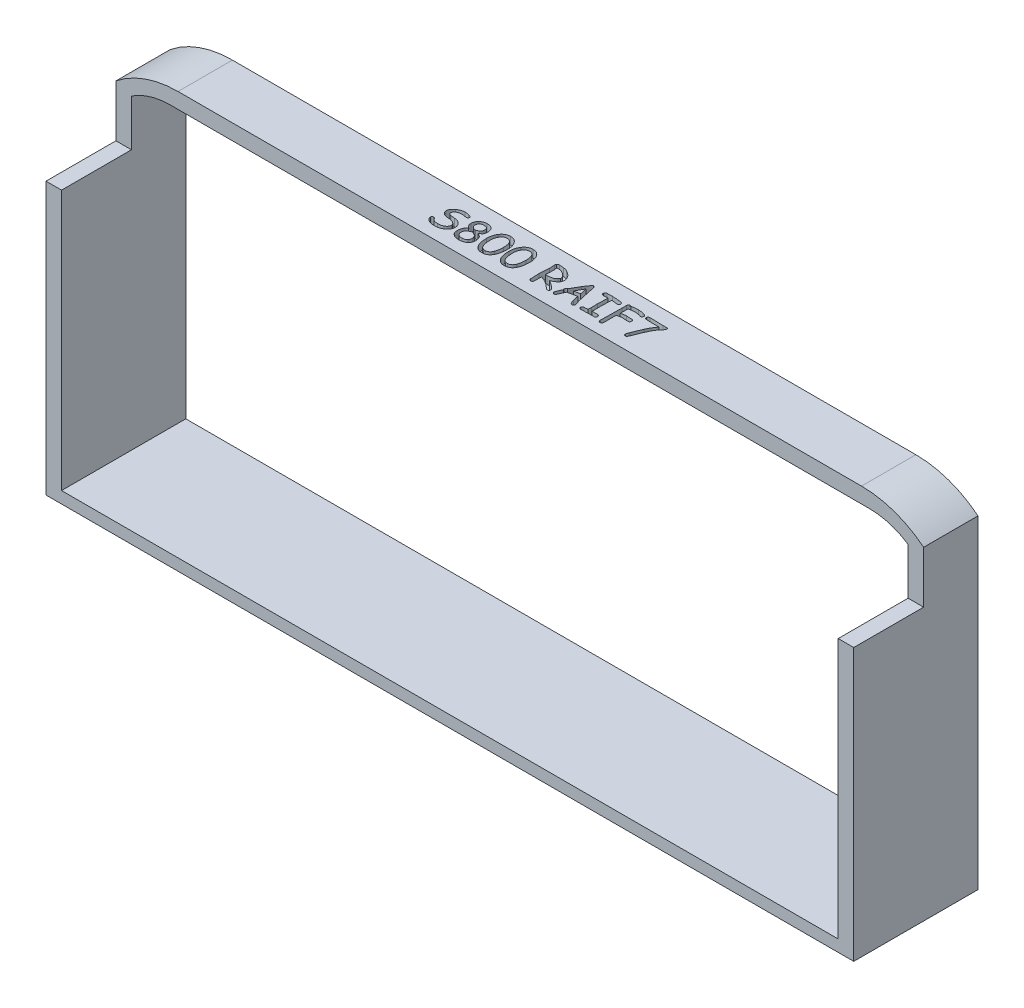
from build123d import *

# Parameters (mm, degrees)
SCHIZZO1_W                   = 100
SCHIZZO1_H                   = 46
ESTRUSIONE_ESTRUSIONE1_DEPTH = 7
SCHIZZO2_W                   = 100
SCHIZZO2_H                   = 39
ESTRUSIONE_ESTRUSIONE2_DEPTH = 9
SCHIZZO4_W                   = 46
SCHIZZO4_H                   = 35
TAGLIO_ESTRUSIONE1_DEPTH     = 58.314919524
SCHIZZO5_W                   = 10
SCHIZZO5_H                   = 2
TAGLIO_ESTRUSIONE2_DEPTH     = 5
SCHIZZO6_R                   = 3
TAGLIO_ESTRUSIONE3_DEPTH     = 104.850854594
TAGLIO_ESTRUSIONE5_DEPTH     = 56.767373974
TAGLIO_ESTRUSIONE7_DEPTH     = 9
TAGLIO_ESTRUSIONE8_DEPTH     = 1
SCHIZZO11_W                  = 100
SCHIZZO11_H                  = 1.5
TAGLIO_ESTRUSIONE9_DEPTH     = 58.314919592
SCHIZZO12_R                  = 7.5
TAGLIO_ESTRUSIONE10_DEPTH    = 58.314919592
ESTRUSIONE_ESTRUSIONE3_DEPTH = 2
ESTRUSIONE_ESTRUSIONE4_DEPTH = 2
TAGLIO_ESTRUSIONE11_DEPTH    = 60.067757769
SCHIZZO17_R                  = 3
TAGLIO_ESTRUSIONE12_DEPTH    = 108.707938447
TAGLIO_ESTRUSIONE13_DEPTH    = 60.067757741
ESTRUSIONE_ESTRUSIONE5_START = -2
SCHIZZO19_R                  = 3
ESTRUSIONE_ESTRUSIONE5_DEPTH = 2
SCHIZZO20_R                  = 3
ESTRUSIONE_ESTRUSIONE6_DEPTH = 2


with BuildPart() as part:
    # Schizzo1 → Estrusione-Estrusione1 (new body)
    with BuildSketch(Plane.XY):
        Rectangle(SCHIZZO1_W, SCHIZZO1_H)
    extrude(amount=ESTRUSIONE_ESTRUSIONE1_DEPTH)

    # Schizzo2 → Estrusione-Estrusione2 (add)
    with BuildSketch(Plane.XY.offset(7)):
        with Locations((0, -3.5)):
            Rectangle(SCHIZZO2_W, SCHIZZO2_H)
    extrude(amount=ESTRUSIONE_ESTRUSIONE2_DEPTH)

    # Schizzo4 → Taglio-Estrusione1 (cut, through all)
    with BuildSketch(Plane(origin=(0, 0, 0), x_dir=(-1, 0, 0), z_dir=(0, 0, -1))):
        with Locations((-4, -2.5)):
            Rectangle(SCHIZZO4_W, SCHIZZO4_H)
    extrude(amount=-TAGLIO_ESTRUSIONE1_DEPTH, mode=Mode.SUBTRACT)

    # Schizzo5 → Taglio-Estrusione2 (cut)
    with BuildSketch(Plane.XY.offset(16)):
        with Locations((33, 15)):
            Rectangle(SCHIZZO5_W, SCHIZZO5_H)
        with Locations((-33, 15)):
            Rectangle(SCHIZZO5_W, SCHIZZO5_H)
    extrude(amount=-TAGLIO_ESTRUSIONE2_DEPTH, mode=Mode.SUBTRACT)

    # Schizzo6 → Taglio-Estrusione3 (cut, through all)
    with BuildSketch(Plane.ZY.offset(50)):
        with Locations((8, -10)):
            Circle(SCHIZZO6_R)
    extrude(amount=-TAGLIO_ESTRUSIONE3_DEPTH, mode=Mode.SUBTRACT)

    # Schizzo8 → Taglio-Estrusione5 (cut, through all)
    with BuildSketch(Plane.XY.offset(7)):
        with BuildLine():
            Line((-50, 21.5), (-51.801726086, 26.913020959))
            Line((-51.801726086, 26.913020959), (-44, 23))
            ThreePointArc((-44, 23), (-47.092329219, 22.619316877), (-50, 21.5))
        make_face()
        with BuildLine():
            Line((50, 21.5), (51.801726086, 26.913020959))
            Line((51.801726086, 26.913020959), (44, 23))
            ThreePointArc((44, 23), (47.092329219, 22.619316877), (50, 21.5))
        make_face()
    extrude(amount=-TAGLIO_ESTRUSIONE5_DEPTH, mode=Mode.SUBTRACT)

    # Schizzo9 → Taglio-Estrusione7 (cut)
    with BuildSketch(Plane.XY.offset(16)):
        with BuildLine():
            Line((-50, 13.5), (-54.500937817, 20.642412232))
            Line((-54.500937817, 20.642412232), (-41, 16))
            ThreePointArc((-41, 16), (-45.670385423, 15.363387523), (-50, 13.5))
        make_face()
        with BuildLine():
            Line((54.500937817, 20.642412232), (41, 16))
            ThreePointArc((41, 16), (45.670385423, 15.363387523), (50, 13.5))
            Line((50, 13.5), (54.500937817, 20.642412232))
        make_face()
    extrude(amount=-TAGLIO_ESTRUSIONE7_DEPTH, mode=Mode.SUBTRACT)

    # Schizzo10 → Taglio-Estrusione8 (cut)
    # profile 1 of 9: a face of its own
    with BuildSketch(Plane(origin=(0, 23, 0), x_dir=(1, 0, 0), z_dir=(0, 1, 0))):
        with BuildLine():
            add(Edge.make_bspline(
                [(-13.759375, -4.761016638), (-13.758942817, -4.745655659), (-13.758107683, -4.715972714), (-13.7451515, -4.673612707), (-13.723420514, -4.635765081), (-13.693168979, -4.603339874), (-13.656859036, -4.576451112), (-13.615671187, -4.55733276), (-13.570380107, -4.546051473), (-13.539095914, -4.544460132), (-13.522851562, -4.543633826)],
                knots=[0, 0, 0, 0, 1.020978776, 1.972898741, 2.919100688, 3.908607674, 4.908561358, 5.914730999, 6.917221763, 8, 8, 8, 8], degree=3))
            add(Edge.make_bspline(
                [(-13.522851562, -4.543633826), (-13.504107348, -4.544962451), (-13.46617671, -4.547651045), (-13.412837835, -4.574254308), (-13.362957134, -4.614185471), (-13.336149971, -4.649778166), (-13.321875, -4.668731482)],
                knots=[0, 0, 0, 0, 0.907817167, 1.837051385, 2.848217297, 4, 4, 4, 4], degree=3))
            add(Edge.make_bspline(
                [(-13.321875, -4.668731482), (-13.303037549, -4.694941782), (-13.267763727, -4.744021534), (-13.214120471, -4.809042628), (-13.163698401, -4.861196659), (-13.128288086, -4.88763416), (-13.112011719, -4.89978617)],
                knots=[0, 0, 0, 0, 1.23447497, 2.31159988, 3.223926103, 4, 4, 4, 4], degree=3))
            add(Edge.make_bspline(
                [(-13.112011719, -4.89978617), (-13.094895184, -4.909973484), (-13.059786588, -4.930869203), (-13.001664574, -4.955546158), (-12.938859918, -4.977881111), (-12.869996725, -4.994388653), (-12.795844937, -5.008073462), (-12.716238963, -5.018465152), (-12.630829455, -5.023565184), (-12.57220604, -5.024434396), (-12.541894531, -5.024883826)],
                knots=[0, 0, 0, 0, 0.807895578, 1.657115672, 2.558318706, 3.511992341, 4.528196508, 5.619539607, 6.769171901, 8, 8, 8, 8], degree=3))
            add(Edge.make_bspline(
                [(-12.541894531, -5.024883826), (-12.512263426, -5.024237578), (-12.453609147, -5.02295834), (-12.366335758, -5.016404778), (-12.280888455, -5.003578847), (-12.196490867, -4.987635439), (-12.113886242, -4.965644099), (-12.033104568, -4.938557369), (-11.953390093, -4.908486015), (-11.902328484, -4.883558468), (-11.876757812, -4.871075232)],
                knots=[0, 0, 0, 0, 1.032504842, 2.043826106, 3.046385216, 4.04124581, 5.034838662, 6.021429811, 7.009170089, 8, 8, 8, 8], degree=3))
            add(Edge.make_bspline(
                [(-11.876757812, -4.871075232), (-11.845614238, -4.854404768), (-11.785913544, -4.822448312), (-11.705422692, -4.765745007), (-11.637526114, -4.704174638), (-11.580668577, -4.638241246), (-11.538258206, -4.566109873), (-11.506695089, -4.489887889), (-11.487818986, -4.408509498), (-11.48553317, -4.352552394), (-11.484375, -4.324200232)],
                knots=[0, 0, 0, 0, 1.189786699, 2.280762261, 3.308288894, 4.272931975, 5.202800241, 6.115543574, 7.045189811, 8, 8, 8, 8], degree=3))
            add(Edge.make_bspline(
                [(-11.484375, -4.324200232), (-11.485497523, -4.300652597), (-11.487700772, -4.254434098), (-11.503053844, -4.186864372), (-11.529351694, -4.12342922), (-11.566354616, -4.063924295), (-11.61329011, -4.008202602), (-11.670771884, -3.956805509), (-11.738393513, -3.909363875), (-11.788495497, -3.8823116), (-11.814550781, -3.868243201)],
                knots=[0, 0, 0, 0, 0.949240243, 1.863136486, 2.777725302, 3.705920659, 4.677662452, 5.705515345, 6.80676479, 8, 8, 8, 8], degree=3))
            add(Edge.make_bspline(
                [(-11.814550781, -3.868243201), (-11.838296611, -3.856443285), (-11.88634789, -3.832565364), (-11.9628831, -3.803813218), (-12.042819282, -3.777578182), (-12.127017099, -3.755662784), (-12.215655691, -3.738672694), (-12.308351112, -3.726170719), (-12.404975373, -3.715933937), (-12.470774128, -3.713582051), (-12.504296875, -3.712383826)],
                knots=[0, 0, 0, 0, 0.891996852, 1.805015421, 2.748548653, 3.723361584, 4.731199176, 5.784448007, 6.871234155, 8, 8, 8, 8], degree=3))
            add(Edge.make_bspline(
                [(-12.504296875, -3.712383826), (-12.534170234, -3.710872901), (-12.592899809, -3.707902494), (-12.679149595, -3.698183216), (-12.761993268, -3.684590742), (-12.841476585, -3.666947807), (-12.917524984, -3.644682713), (-12.990750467, -3.62000893), (-13.060128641, -3.589765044), (-13.103960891, -3.566168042), (-13.125683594, -3.55447367)],
                knots=[0, 0, 0, 0, 1.109083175, 2.180403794, 3.216792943, 4.22137708, 5.197588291, 6.154329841, 7.085309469, 8, 8, 8, 8], degree=3))
            add(Edge.make_bspline(
                [(-13.125683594, -3.55447367), (-13.151605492, -3.538888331), (-13.202133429, -3.508508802), (-13.269216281, -3.454296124), (-13.326397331, -3.395050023), (-13.372090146, -3.330133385), (-13.409564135, -3.261243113), (-13.434198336, -3.186399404), (-13.450993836, -3.107012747), (-13.452403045, -3.052124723), (-13.453125, -3.02400492)],
                knots=[0, 0, 0, 0, 1.104423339, 2.152783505, 3.142433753, 4.103820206, 5.046408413, 5.997202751, 6.973942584, 8, 8, 8, 8], degree=3))
            add(Edge.make_bspline(
                [(-13.453125, -3.02400492), (-13.45161262, -2.990395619), (-13.448576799, -2.922931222), (-13.425908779, -2.823397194), (-13.388960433, -2.726193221), (-13.337332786, -2.631359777), (-13.269636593, -2.539758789), (-13.189741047, -2.448933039), (-13.093448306, -2.361853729), (-13.022002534, -2.308164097), (-12.984863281, -2.28025492)],
                knots=[0, 0, 0, 0, 0.882315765, 1.771084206, 2.667078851, 3.607169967, 4.597299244, 5.653059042, 6.780002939, 8, 8, 8, 8], degree=3))
            add(Edge.make_bspline(
                [(-12.984863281, -2.28025492), (-12.947864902, -2.254831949), (-12.875024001, -2.204780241), (-12.761009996, -2.14088604), (-12.646704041, -2.085854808), (-12.531495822, -2.040277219), (-12.415085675, -2.00527028), (-12.297727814, -1.980880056), (-12.179573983, -1.964924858), (-12.100343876, -1.963232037), (-12.060644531, -1.962383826)],
                knots=[0, 0, 0, 0, 1.084105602, 2.134342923, 3.153783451, 4.147494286, 5.124611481, 6.086661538, 7.041295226, 8, 8, 8, 8], degree=3))
            add(Edge.make_bspline(
                [(-12.060644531, -1.962383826), (-12.021874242, -1.963430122), (-11.941835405, -1.965590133), (-11.818210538, -1.979839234), (-11.687730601, -2.003985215), (-11.599107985, -2.026151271), (-11.553417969, -2.037579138)],
                knots=[0, 0, 0, 0, 0.904920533, 1.868151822, 2.900910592, 4, 4, 4, 4], degree=3))
            add(Edge.make_bspline(
                [(-11.553417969, -2.037579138), (-11.523914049, -2.045649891), (-11.468544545, -2.060796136), (-11.391971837, -2.087564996), (-11.326831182, -2.115571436), (-11.273565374, -2.146338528), (-11.231677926, -2.17836669), (-11.20077607, -2.212011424), (-11.182217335, -2.248972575), (-11.179465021, -2.27460916), (-11.178125, -2.287090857)],
                knots=[0, 0, 0, 0, 1.536451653, 2.883432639, 4.072626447, 5.093694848, 5.966289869, 6.712663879, 7.373234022, 8, 8, 8, 8], degree=3))
            add(Edge.make_bspline(
                [(-11.178125, -2.287090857), (-11.178716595, -2.302878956), (-11.179826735, -2.332505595), (-11.189695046, -2.37391076), (-11.20495608, -2.409665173), (-11.228475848, -2.438803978), (-11.258753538, -2.460924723), (-11.295095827, -2.476883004), (-11.337934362, -2.485370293), (-11.368356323, -2.486683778), (-11.384570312, -2.487383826)],
                knots=[0, 0, 0, 0, 1.147274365, 2.152880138, 3.080677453, 3.953489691, 4.842381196, 5.785320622, 6.819642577, 8, 8, 8, 8], degree=3))
            add(Edge.make_bspline(
                [(-11.384570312, -2.487383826), (-11.402823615, -2.486759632), (-11.44518718, -2.485310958), (-11.517081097, -2.474878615), (-11.606376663, -2.461978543), (-11.707182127, -2.442019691), (-11.810098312, -2.422351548), (-11.905434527, -2.408790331), (-11.988021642, -2.400215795), (-12.038753, -2.39998818), (-12.062011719, -2.399883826)],
                knots=[0, 0, 0, 0, 0.64035602, 1.486183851, 2.545593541, 3.806237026, 5.090462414, 6.221050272, 7.184407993, 8, 8, 8, 8], degree=3))
            add(Edge.make_bspline(
                [(-12.062011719, -2.399883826), (-12.091428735, -2.400891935), (-12.149246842, -2.402873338), (-12.233944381, -2.411912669), (-12.315314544, -2.425435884), (-12.393262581, -2.444542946), (-12.468066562, -2.469101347), (-12.539193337, -2.499441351), (-12.607287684, -2.534051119), (-12.649883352, -2.561310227), (-12.67109375, -2.574883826)],
                knots=[0, 0, 0, 0, 1.098563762, 2.159188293, 3.177307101, 4.17590561, 5.152410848, 6.113039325, 7.060393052, 8, 8, 8, 8], degree=3))
            add(Edge.make_bspline(
                [(-12.67109375, -2.574883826), (-12.69147652, -2.589270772), (-12.730983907, -2.617156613), (-12.783256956, -2.664881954), (-12.827666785, -2.714612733), (-12.864992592, -2.766441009), (-12.892862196, -2.82122888), (-12.912959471, -2.878225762), (-12.925892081, -2.937521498), (-12.927374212, -2.978137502), (-12.928125, -2.998711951)],
                knots=[0, 0, 0, 0, 1.156832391, 2.242257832, 3.2758141, 4.246901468, 5.197449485, 6.117149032, 7.046222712, 8, 8, 8, 8], degree=3))
            add(Edge.make_bspline(
                [(-12.928125, -2.998711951), (-12.927025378, -3.013881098), (-12.924831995, -3.044138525), (-12.908433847, -3.087614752), (-12.880577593, -3.126854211), (-12.841967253, -3.161764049), (-12.79333696, -3.193110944), (-12.734593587, -3.221203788), (-12.66485104, -3.244663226), (-12.614456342, -3.257258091), (-12.587695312, -3.263946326)],
                knots=[0, 0, 0, 0, 0.779947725, 1.555737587, 2.356322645, 3.236265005, 4.218915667, 5.326038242, 6.580049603, 8, 8, 8, 8], degree=3))
            add(Edge.make_bspline(
                [(-12.587695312, -3.263946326), (-12.575870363, -3.266578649), (-12.550073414, -3.272321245), (-12.507099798, -3.278808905), (-12.456957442, -3.285568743), (-12.399296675, -3.292385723), (-12.334347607, -3.299190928), (-12.262100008, -3.305896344), (-12.18238295, -3.313008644), (-12.126734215, -3.316699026), (-12.097558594, -3.318633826)],
                knots=[0, 0, 0, 0, 0.588960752, 1.284858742, 2.112302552, 3.049675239, 4.108181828, 5.287978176, 6.578136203, 8, 8, 8, 8], degree=3))
            add(Edge.make_bspline(
                [(-12.097558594, -3.318633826), (-12.054863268, -3.32253056), (-11.971333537, -3.330154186), (-11.850299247, -3.352450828), (-11.73610984, -3.381572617), (-11.629128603, -3.419008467), (-11.529549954, -3.46519621), (-11.436743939, -3.518397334), (-11.351254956, -3.580091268), (-11.300041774, -3.627317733), (-11.274511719, -3.650860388)],
                knots=[0, 0, 0, 0, 1.134643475, 2.219832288, 3.254399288, 4.252361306, 5.2160512, 6.156708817, 7.081109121, 8, 8, 8, 8], degree=3))
            add(Edge.make_bspline(
                [(-11.274511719, -3.650860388), (-11.252848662, -3.673229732), (-11.210023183, -3.717451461), (-11.154744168, -3.790244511), (-11.107801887, -3.866731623), (-11.069314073, -3.946838), (-11.03990526, -4.030833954), (-11.018713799, -4.118283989), (-11.005221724, -4.209392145), (-11.003830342, -4.271515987), (-11.003125, -4.303008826)],
                knots=[0, 0, 0, 0, 1.028307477, 2.03285068, 3.013053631, 3.989779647, 4.963831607, 5.94821947, 6.959877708, 8, 8, 8, 8], degree=3))
            add(Edge.make_bspline(
                [(-11.003125, -4.303008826), (-11.004696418, -4.347553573), (-11.007790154, -4.435251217), (-11.032371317, -4.563071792), (-11.072013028, -4.684233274), (-11.128879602, -4.797897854), (-11.201387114, -4.904687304), (-11.289926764, -5.004431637), (-11.394403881, -5.097346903), (-11.473242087, -5.151073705), (-11.513769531, -5.17869242)],
                knots=[0, 0, 0, 0, 1.006906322, 1.982350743, 2.932524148, 3.882138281, 4.847028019, 5.843859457, 6.891617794, 8, 8, 8, 8], degree=3))
            add(Edge.make_bspline(
                [(-11.513769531, -5.17869242), (-11.551051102, -5.201354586), (-11.625703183, -5.246732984), (-11.743576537, -5.304803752), (-11.866242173, -5.353306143), (-11.993164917, -5.392751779), (-12.124076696, -5.424841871), (-12.259729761, -5.445871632), (-12.39961323, -5.460529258), (-12.494459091, -5.461759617), (-12.542578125, -5.462383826)],
                knots=[0, 0, 0, 0, 0.96740237, 1.93711262, 2.910412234, 3.890342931, 4.88332579, 5.897071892, 6.933101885, 8, 8, 8, 8], degree=3))
            add(Edge.make_bspline(
                [(-12.542578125, -5.462383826), (-12.577684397, -5.461832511), (-12.647065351, -5.46074294), (-12.750157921, -5.452833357), (-12.850885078, -5.441067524), (-12.949351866, -5.422798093), (-13.045467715, -5.400488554), (-13.139567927, -5.373102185), (-13.231299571, -5.340340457), (-13.290789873, -5.314598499), (-13.320507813, -5.301739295)],
                knots=[0, 0, 0, 0, 1.052595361, 2.080257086, 3.098952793, 4.092052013, 5.081501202, 6.056668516, 7.029223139, 8, 8, 8, 8], degree=3))
            add(Edge.make_bspline(
                [(-13.320507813, -5.301739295), (-13.354605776, -5.285337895), (-13.420117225, -5.253826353), (-13.508727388, -5.197319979), (-13.584965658, -5.137021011), (-13.646338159, -5.070278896), (-13.696242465, -5.000312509), (-13.731261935, -4.924482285), (-13.754251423, -4.844362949), (-13.7576566, -4.788970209), (-13.759375, -4.761016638)],
                knots=[0, 0, 0, 0, 1.230486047, 2.364097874, 3.413457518, 4.384300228, 5.305970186, 6.198444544, 7.090857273, 8, 8, 8, 8], degree=3))
        make_face()
    # profile 2 of 9: a face of its own
    with BuildSketch(Plane(origin=(0, 23, 0), x_dir=(1, 0, 0), z_dir=(0, 1, 0))):
        with BuildLine():
            add(Edge.make_bspline(
                [(-9.385742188, -5.462383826), (-9.42540997, -5.461701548), (-9.502813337, -5.460370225), (-9.616085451, -5.450754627), (-9.723502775, -5.434645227), (-9.825084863, -5.411186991), (-9.920941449, -5.382039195), (-10.011072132, -5.346303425), (-10.095721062, -5.304416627), (-10.147586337, -5.270153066), (-10.173242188, -5.253204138)],
                knots=[0, 0, 0, 0, 1.150586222, 2.245127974, 3.294927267, 4.298665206, 5.266707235, 6.198319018, 7.108774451, 8, 8, 8, 8], degree=3))
            add(Edge.make_bspline(
                [(-10.173242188, -5.253204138), (-10.20041821, -5.232858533), (-10.253803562, -5.192891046), (-10.324214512, -5.122913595), (-10.384253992, -5.046110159), (-10.432764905, -4.961563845), (-10.472589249, -4.871098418), (-10.499035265, -4.772838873), (-10.517747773, -4.668514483), (-10.520475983, -4.596358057), (-10.521875, -4.559356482)],
                knots=[0, 0, 0, 0, 1.006362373, 1.976926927, 2.935834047, 3.890249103, 4.862413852, 5.859901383, 6.902564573, 8, 8, 8, 8], degree=3))
            add(Edge.make_bspline(
                [(-10.521875, -4.559356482), (-10.521976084, -4.529269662), (-10.522173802, -4.470420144), (-10.516911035, -4.38400334), (-10.509341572, -4.301062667), (-10.49605454, -4.221954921), (-10.479561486, -4.146473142), (-10.460377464, -4.07441144), (-10.434943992, -4.006567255), (-10.407810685, -3.941619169), (-10.374732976, -3.88119381), (-10.339865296, -3.823275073), (-10.29894391, -3.770189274), (-10.255398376, -3.72012559), (-10.207790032, -3.673700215), (-10.155676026, -3.631781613), (-10.100421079, -3.592150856), (-10.060676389, -3.56983413), (-10.040625, -3.558575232)],
                knots=[0, 0, 0, 0, 1.231335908, 2.408480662, 3.54270984, 4.639180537, 5.689402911, 6.705516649, 7.688153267, 8.653323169, 9.583931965, 10.505473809, 11.417763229, 12.323351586, 13.220493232, 14.135401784, 15.059301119, 16, 16, 16, 16], degree=3))
            add(Edge.make_bspline(
                [(-10.040625, -3.558575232), (-10.071929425, -3.537184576), (-10.132964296, -3.495478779), (-10.213616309, -3.422205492), (-10.282116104, -3.342443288), (-10.337832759, -3.255634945), (-10.381491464, -3.162342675), (-10.412147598, -3.06226641), (-10.431043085, -2.955675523), (-10.433248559, -2.882352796), (-10.434375, -2.844903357)],
                knots=[0, 0, 0, 0, 1.064939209, 2.07633356, 3.053300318, 4.012889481, 4.967268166, 5.939877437, 6.947796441, 8, 8, 8, 8], degree=3))
            add(Edge.make_bspline(
                [(-10.434375, -2.844903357), (-10.433534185, -2.809074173), (-10.431876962, -2.738455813), (-10.416415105, -2.634880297), (-10.391275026, -2.535796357), (-10.355343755, -2.441729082), (-10.310116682, -2.352125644), (-10.254227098, -2.267644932), (-10.188266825, -2.187808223), (-10.137963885, -2.139415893), (-10.112402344, -2.114825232)],
                knots=[0, 0, 0, 0, 1.044078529, 2.057850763, 3.045601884, 4.019130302, 4.98772713, 5.966162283, 6.966501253, 8, 8, 8, 8], degree=3))
            add(Edge.make_bspline(
                [(-10.112402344, -2.114825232), (-10.086373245, -2.092438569), (-10.034979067, -2.048236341), (-9.951244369, -1.991202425), (-9.863853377, -1.942660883), (-9.772172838, -1.902479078), (-9.676063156, -1.871925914), (-9.576100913, -1.849548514), (-9.472089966, -1.834509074), (-9.401289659, -1.832272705), (-9.365234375, -1.831133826)],
                knots=[0, 0, 0, 0, 1.007032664, 1.988375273, 2.967321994, 3.937732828, 4.921238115, 5.922323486, 6.941936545, 8, 8, 8, 8], degree=3))
            add(Edge.make_bspline(
                [(-9.365234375, -1.831133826), (-9.325332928, -1.831456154), (-9.248118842, -1.832079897), (-9.135940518, -1.842639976), (-9.031284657, -1.859775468), (-8.934433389, -1.885754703), (-8.845429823, -1.919563), (-8.763468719, -1.96009999), (-8.690129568, -2.01004924), (-8.62323025, -2.066324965), (-8.56538044, -2.131625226), (-8.514966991, -2.204170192), (-8.472360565, -2.284253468), (-8.43751715, -2.372045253), (-8.411028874, -2.467911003), (-8.392276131, -2.571098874), (-8.380403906, -2.681933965), (-8.378901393, -2.75828337), (-8.378125, -2.797735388)],
                knots=[0, 0, 0, 0, 1.205103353, 2.332019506, 3.4004497, 4.40579985, 5.355811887, 6.273312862, 7.161200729, 8.030395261, 8.908001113, 9.788410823, 10.693926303, 11.642515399, 12.636415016, 13.693696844, 14.808264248, 16, 16, 16, 16], degree=3))
            add(Edge.make_bspline(
                [(-8.378125, -2.797735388), (-8.378555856, -2.820304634), (-8.379397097, -2.864370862), (-8.384826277, -2.928304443), (-8.393756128, -2.988350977), (-8.40577563, -3.044455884), (-8.422003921, -3.096770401), (-8.443131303, -3.14455966), (-8.465450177, -3.189611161), (-8.484837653, -3.216103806), (-8.494335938, -3.229083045)],
                knots=[0, 0, 0, 0, 1.191574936, 2.326538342, 3.384819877, 4.394816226, 5.3536473, 6.269869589, 7.152376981, 8, 8, 8, 8], degree=3))
            add(Edge.make_bspline(
                [(-8.494335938, -3.229083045), (-8.50309243, -3.239674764), (-8.521397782, -3.26181664), (-8.552792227, -3.29428993), (-8.591010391, -3.325133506), (-8.633532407, -3.357760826), (-8.68200244, -3.390270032), (-8.736105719, -3.423024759), (-8.79562456, -3.455876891), (-8.837643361, -3.476707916), (-8.859375, -3.487481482)],
                knots=[0, 0, 0, 0, 0.731535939, 1.529268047, 2.399004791, 3.342738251, 4.382323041, 5.503618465, 6.708900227, 8, 8, 8, 8], degree=3))
            add(Edge.make_bspline(
                [(-8.859375, -3.487481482), (-8.831237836, -3.501625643), (-8.776482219, -3.529150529), (-8.698298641, -3.57287652), (-8.626967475, -3.617718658), (-8.561949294, -3.663063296), (-8.503581, -3.709514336), (-8.452010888, -3.757276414), (-8.405828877, -3.804966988), (-8.380296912, -3.839252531), (-8.367871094, -3.855938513)],
                knots=[0, 0, 0, 0, 1.218375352, 2.370988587, 3.464389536, 4.477000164, 5.436683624, 6.347627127, 7.19582823, 8, 8, 8, 8], degree=3))
            add(Edge.make_bspline(
                [(-8.367871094, -3.855938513), (-8.354726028, -3.875989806), (-8.328107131, -3.916593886), (-8.294596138, -3.983069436), (-8.26589905, -4.05484485), (-8.242693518, -4.132422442), (-8.225320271, -4.215261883), (-8.21209168, -4.303334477), (-8.204804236, -4.39699355), (-8.203694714, -4.461362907), (-8.203125, -4.494415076)],
                knots=[0, 0, 0, 0, 0.85865964, 1.73879484, 2.662260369, 3.625867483, 4.636490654, 5.693174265, 6.815498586, 8, 8, 8, 8], degree=3))
            add(Edge.make_bspline(
                [(-8.203125, -4.494415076), (-8.204134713, -4.53207121), (-8.206109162, -4.605706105), (-8.222709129, -4.712863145), (-8.250460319, -4.81357743), (-8.287559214, -4.908687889), (-8.33777275, -4.996950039), (-8.398065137, -5.079067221), (-8.46900239, -5.155617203), (-8.523807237, -5.199419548), (-8.551757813, -5.221758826)],
                knots=[0, 0, 0, 0, 1.077781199, 2.107553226, 3.095210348, 4.064443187, 5.022611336, 5.993489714, 6.976675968, 8, 8, 8, 8], degree=3))
            add(Edge.make_bspline(
                [(-8.551757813, -5.221758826), (-8.579472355, -5.240931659), (-8.635211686, -5.279491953), (-8.725063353, -5.328751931), (-8.820968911, -5.369642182), (-8.922253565, -5.404287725), (-9.030210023, -5.42963021), (-9.143612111, -5.4491059), (-9.262949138, -5.459746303), (-9.344251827, -5.461492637), (-9.385742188, -5.462383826)],
                knots=[0, 0, 0, 0, 0.915599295, 1.841448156, 2.779154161, 3.746719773, 4.747207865, 5.789884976, 6.872134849, 8, 8, 8, 8], degree=3))
        make_face()
        with BuildLine():
            add(Edge.make_bspline(
                [(-9.370703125, -2.224883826), (-9.396249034, -2.225363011), (-9.445658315, -2.22628982), (-9.517455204, -2.23473405), (-9.584566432, -2.24812227), (-9.647273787, -2.267445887), (-9.705521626, -2.291681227), (-9.758696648, -2.322392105), (-9.807816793, -2.357639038), (-9.836344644, -2.385817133), (-9.850585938, -2.399883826)],
                knots=[0, 0, 0, 0, 1.166319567, 2.255821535, 3.296722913, 4.287570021, 5.248226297, 6.1711634, 7.087032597, 8, 8, 8, 8], degree=3))
            add(Edge.make_bspline(
                [(-9.850585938, -2.399883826), (-9.86256267, -2.413739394), (-9.886622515, -2.441573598), (-9.916401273, -2.488497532), (-9.941872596, -2.538607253), (-9.962448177, -2.592231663), (-9.977979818, -2.649541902), (-9.989884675, -2.710255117), (-9.995665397, -2.774834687), (-9.996465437, -2.818917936), (-9.996875, -2.841485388)],
                knots=[0, 0, 0, 0, 0.921577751, 1.851341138, 2.790833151, 3.750173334, 4.73887197, 5.779012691, 6.863014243, 8, 8, 8, 8], degree=3))
            add(Edge.make_bspline(
                [(-9.996875, -2.841485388), (-9.994937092, -2.868598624), (-9.991095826, -2.922341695), (-9.963118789, -2.999182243), (-9.917786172, -3.069353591), (-9.854750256, -3.132562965), (-9.774760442, -3.189338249), (-9.677773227, -3.239702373), (-9.563749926, -3.283960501), (-9.480780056, -3.306659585), (-9.437011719, -3.318633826)],
                knots=[0, 0, 0, 0, 0.819179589, 1.623754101, 2.442237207, 3.329483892, 4.307196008, 5.398864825, 6.627846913, 8, 8, 8, 8], degree=3))
            add(Edge.make_bspline(
                [(-9.437011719, -3.318633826), (-9.391529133, -3.304924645), (-9.307045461, -3.279459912), (-9.191529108, -3.238021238), (-9.096423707, -3.19671045), (-9.042335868, -3.164831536), (-9.01796875, -3.150469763)],
                knots=[0, 0, 0, 0, 1.258491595, 2.337641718, 3.251090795, 4, 4, 4, 4], degree=3))
            add(Edge.make_bspline(
                [(-9.01796875, -3.150469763), (-9.002041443, -3.139127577), (-8.970867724, -3.116928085), (-8.92864174, -3.079708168), (-8.894481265, -3.037760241), (-8.86531454, -2.994353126), (-8.843368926, -2.947435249), (-8.826295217, -2.898127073), (-8.817982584, -2.845179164), (-8.816417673, -2.809149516), (-8.815625, -2.790899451)],
                knots=[0, 0, 0, 0, 1.087859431, 2.129212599, 3.119451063, 4.090013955, 5.031402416, 5.993648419, 6.983724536, 8, 8, 8, 8], degree=3))
            add(Edge.make_bspline(
                [(-8.815625, -2.790899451), (-8.815856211, -2.764672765), (-8.816301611, -2.714150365), (-8.824219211, -2.64153472), (-8.835688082, -2.575056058), (-8.85079989, -2.51425575), (-8.872529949, -2.46001098), (-8.89728242, -2.411102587), (-8.927748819, -2.36841374), (-8.951982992, -2.34464391), (-8.963964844, -2.332891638)],
                knots=[0, 0, 0, 0, 1.269860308, 2.446225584, 3.533280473, 4.53729939, 5.474077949, 6.357848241, 7.188087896, 8, 8, 8, 8], degree=3))
            add(Edge.make_bspline(
                [(-8.963964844, -2.332891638), (-8.975147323, -2.324152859), (-8.998081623, -2.306230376), (-9.037611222, -2.284547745), (-9.081746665, -2.266291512), (-9.130281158, -2.250282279), (-9.183745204, -2.239079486), (-9.241774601, -2.231087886), (-9.304504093, -2.225211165), (-9.348129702, -2.224995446), (-9.370703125, -2.224883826)],
                knots=[0, 0, 0, 0, 0.792732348, 1.625825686, 2.511095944, 3.462258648, 4.47967608, 5.561093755, 6.738024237, 8, 8, 8, 8], degree=3))
        make_face(mode=Mode.SUBTRACT)
        with BuildLine():
            add(Edge.make_bspline(
                [(-9.408984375, -3.712383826), (-9.438704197, -3.726084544), (-9.495728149, -3.752372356), (-9.576379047, -3.793435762), (-9.650428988, -3.83056377), (-9.715275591, -3.869147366), (-9.773869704, -3.903756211), (-9.823470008, -3.939074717), (-9.866556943, -3.971407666), (-9.891085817, -3.994281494), (-9.902539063, -4.004961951)],
                knots=[0, 0, 0, 0, 1.363173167, 2.615544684, 3.770398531, 4.812451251, 5.758359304, 6.603701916, 7.348027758, 8, 8, 8, 8], degree=3))
            add(Edge.make_bspline(
                [(-9.902539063, -4.004961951), (-9.917988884, -4.021246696), (-9.948859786, -4.053785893), (-9.987860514, -4.108976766), (-10.020323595, -4.169162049), (-10.045958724, -4.234207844), (-10.066271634, -4.303923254), (-10.078587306, -4.378486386), (-10.085960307, -4.457811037), (-10.084914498, -4.51217258), (-10.084375, -4.540215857)],
                knots=[0, 0, 0, 0, 0.924057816, 1.846396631, 2.774880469, 3.735611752, 4.72228466, 5.761188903, 6.845073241, 8, 8, 8, 8], degree=3))
            add(Edge.make_bspline(
                [(-10.084375, -4.540215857), (-10.082956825, -4.563309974), (-10.080177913, -4.608562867), (-10.065368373, -4.67378964), (-10.043547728, -4.734543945), (-10.013782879, -4.790830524), (-9.975671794, -4.842319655), (-9.930271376, -4.889692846), (-9.877160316, -4.932791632), (-9.837036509, -4.956140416), (-9.81640625, -4.968145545)],
                knots=[0, 0, 0, 0, 1.045353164, 2.048368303, 3.013695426, 3.959109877, 4.917919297, 5.902270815, 6.921421, 8, 8, 8, 8], degree=3))
            add(Edge.make_bspline(
                [(-9.81640625, -4.968145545), (-9.784180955, -4.983634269), (-9.719290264, -5.014823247), (-9.614150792, -5.045449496), (-9.503186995, -5.065571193), (-9.42685223, -5.067597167), (-9.387792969, -5.068633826)],
                knots=[0, 0, 0, 0, 0.963920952, 1.941006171, 2.946446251, 4, 4, 4, 4], degree=3))
            add(Edge.make_bspline(
                [(-9.387792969, -5.068633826), (-9.354958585, -5.068203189), (-9.291665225, -5.067373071), (-9.200468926, -5.058419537), (-9.116691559, -5.043700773), (-9.040683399, -5.022617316), (-8.972445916, -4.996133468), (-8.911839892, -4.963668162), (-8.858669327, -4.925102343), (-8.82931525, -4.893882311), (-8.814941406, -4.878594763)],
                knots=[0, 0, 0, 0, 1.266534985, 2.441442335, 3.531365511, 4.544620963, 5.480131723, 6.349516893, 7.191806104, 8, 8, 8, 8], degree=3))
            add(Edge.make_bspline(
                [(-8.814941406, -4.878594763), (-8.804358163, -4.865387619), (-8.782840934, -4.838535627), (-8.756197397, -4.793007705), (-8.734588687, -4.742491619), (-8.715966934, -4.687708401), (-8.701780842, -4.627960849), (-8.691620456, -4.563290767), (-8.685486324, -4.493850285), (-8.684752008, -4.445892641), (-8.684375, -4.421270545)],
                knots=[0, 0, 0, 0, 0.835931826, 1.699567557, 2.597496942, 3.548686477, 4.556938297, 5.62929883, 6.782850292, 8, 8, 8, 8], degree=3))
            add(Edge.make_bspline(
                [(-8.684375, -4.421270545), (-8.684856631, -4.39683044), (-8.685798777, -4.349021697), (-8.69837174, -4.27923561), (-8.716279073, -4.212748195), (-8.742519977, -4.150033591), (-8.77640312, -4.091305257), (-8.817895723, -4.036636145), (-8.865891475, -3.984398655), (-8.903165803, -3.954152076), (-8.922265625, -3.938653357)],
                knots=[0, 0, 0, 0, 1.048418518, 2.050873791, 3.036366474, 4.001577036, 4.961862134, 5.940624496, 6.944750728, 8, 8, 8, 8], degree=3))
            add(Edge.make_bspline(
                [(-8.922265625, -3.938653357), (-8.936301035, -3.928271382), (-8.965428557, -3.906725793), (-9.012565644, -3.875801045), (-9.065573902, -3.846609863), (-9.123775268, -3.817963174), (-9.187274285, -3.789788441), (-9.25673176, -3.763616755), (-9.330766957, -3.736605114), (-9.382477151, -3.720592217), (-9.408984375, -3.712383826)],
                knots=[0, 0, 0, 0, 0.776361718, 1.611174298, 2.50492424, 3.465734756, 4.495722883, 5.592915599, 6.766101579, 8, 8, 8, 8], degree=3))
        make_face(mode=Mode.SUBTRACT)
    # profile 3 of 9: a face of its own
    with BuildSketch(Plane(origin=(0, 23, 0), x_dir=(1, 0, 0), z_dir=(0, 1, 0))):
        with BuildLine():
            add(Edge.make_bspline(
                [(-6.495507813, -5.418633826), (-6.524236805, -5.418080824), (-6.580881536, -5.416990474), (-6.664417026, -5.409188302), (-6.7451459, -5.397321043), (-6.822705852, -5.379206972), (-6.897244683, -5.356849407), (-6.969003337, -5.32922689), (-7.037707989, -5.29679098), (-7.103166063, -5.258485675), (-7.16605775, -5.216436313), (-7.225918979, -5.16885773), (-7.28280423, -5.116048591), (-7.336450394, -5.058021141), (-7.387574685, -4.995370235), (-7.43509658, -4.927504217), (-7.480787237, -4.855091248), (-7.5073737, -4.803611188), (-7.520898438, -4.777422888)],
                knots=[0, 0, 0, 0, 1.075897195, 2.12133812, 3.140066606, 4.129671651, 5.101638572, 6.052620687, 7.007005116, 7.943865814, 8.890702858, 9.838385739, 10.804640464, 11.795018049, 12.796039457, 13.830835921, 14.89652965, 16, 16, 16, 16], degree=3))
            add(Edge.make_bspline(
                [(-7.520898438, -4.777422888), (-7.540702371, -4.735092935), (-7.581164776, -4.648606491), (-7.630403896, -4.510788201), (-7.67214198, -4.363894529), (-7.705887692, -4.207625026), (-7.733420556, -4.042296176), (-7.75230658, -3.867474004), (-7.76302674, -3.683581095), (-7.764745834, -3.557905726), (-7.765625, -3.493633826)],
                knots=[0, 0, 0, 0, 0.850559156, 1.737819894, 2.661087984, 3.629555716, 4.647253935, 5.711625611, 6.829697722, 8, 8, 8, 8], degree=3))
            add(Edge.make_bspline(
                [(-7.765625, -3.493633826), (-7.764788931, -3.438683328), (-7.763144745, -3.330619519), (-7.74766916, -3.171189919), (-7.722351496, -3.017085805), (-7.687699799, -2.868093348), (-7.643130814, -2.724299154), (-7.588340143, -2.586034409), (-7.523633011, -2.452851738), (-7.4725744, -2.368749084), (-7.447070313, -2.326739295)],
                knots=[0, 0, 0, 0, 1.075274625, 2.114599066, 3.131540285, 4.130036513, 5.106181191, 6.07514741, 7.038524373, 8, 8, 8, 8], degree=3))
            add(Edge.make_bspline(
                [(-7.447070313, -2.326739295), (-7.431403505, -2.303067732), (-7.400388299, -2.256205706), (-7.349624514, -2.190454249), (-7.297831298, -2.128236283), (-7.24275817, -2.071642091), (-7.186227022, -2.018824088), (-7.127326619, -1.970823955), (-7.066166, -1.927725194), (-7.003355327, -1.888566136), (-6.938250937, -1.854272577), (-6.870943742, -1.824976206), (-6.801897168, -1.799465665), (-6.730608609, -1.778938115), (-6.657005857, -1.763324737), (-6.581485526, -1.751697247), (-6.503619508, -1.744613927), (-6.451089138, -1.743963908), (-6.424414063, -1.743633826)],
                knots=[0, 0, 0, 0, 1.104903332, 2.18735074, 3.232466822, 4.255238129, 5.259720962, 6.243537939, 7.210976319, 8.171186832, 9.123660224, 10.073153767, 11.02748484, 11.987818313, 12.958830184, 13.955129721, 14.961608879, 16, 16, 16, 16], degree=3))
            add(Edge.make_bspline(
                [(-6.424414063, -1.743633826), (-6.375098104, -1.745200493), (-6.27859819, -1.748266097), (-6.138171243, -1.772526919), (-6.006009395, -1.813095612), (-5.882371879, -1.870181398), (-5.766861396, -1.943155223), (-5.661288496, -2.033619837), (-5.562148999, -2.138259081), (-5.506249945, -2.218615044), (-5.477636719, -2.259747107)],
                knots=[0, 0, 0, 0, 1.049013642, 2.052676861, 3.022029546, 3.983185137, 4.942332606, 5.919585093, 6.935091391, 8, 8, 8, 8], degree=3))
            add(Edge.make_bspline(
                [(-5.477636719, -2.259747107), (-5.453935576, -2.297636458), (-5.406387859, -2.37364765), (-5.347186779, -2.495416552), (-5.297445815, -2.623194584), (-5.255397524, -2.756641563), (-5.223353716, -2.896551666), (-5.201173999, -3.042575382), (-5.187133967, -3.194629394), (-5.185305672, -3.298094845), (-5.184375, -3.350762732)],
                knots=[0, 0, 0, 0, 0.935519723, 1.876779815, 2.830384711, 3.805494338, 4.804589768, 5.833260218, 6.897046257, 8, 8, 8, 8], degree=3))
            add(Edge.make_bspline(
                [(-5.184375, -3.350762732), (-5.185082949, -3.434192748), (-5.186453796, -3.595743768), (-5.202945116, -3.82996909), (-5.227039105, -4.048335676), (-5.263676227, -4.250472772), (-5.308388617, -4.437090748), (-5.365557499, -4.607191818), (-5.431074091, -4.762116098), (-5.508624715, -4.900179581), (-5.595799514, -5.022498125), (-5.693230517, -5.129144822), (-5.802303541, -5.21841101), (-5.920806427, -5.29259266), (-6.049991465, -5.349633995), (-6.189522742, -5.389943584), (-6.339269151, -5.414032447), (-6.442553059, -5.417074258), (-6.495507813, -5.418633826)],
                knots=[0, 0, 0, 0, 1.446337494, 2.800638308, 4.069463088, 5.253675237, 6.360475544, 7.39374828, 8.361820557, 9.272871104, 10.133594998, 10.961236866, 11.769642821, 12.569985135, 13.378333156, 14.209785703, 15.08213818, 16, 16, 16, 16], degree=3))
        make_face()
        with BuildLine():
            add(Edge.make_bspline(
                [(-6.441503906, -2.181133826), (-6.476245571, -2.182390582), (-6.544534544, -2.184860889), (-6.644043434, -2.206103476), (-6.738052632, -2.240448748), (-6.82643729, -2.288979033), (-6.909080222, -2.351319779), (-6.985960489, -2.427208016), (-7.056859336, -2.517079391), (-7.09776509, -2.583989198), (-7.118945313, -2.618633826)],
                knots=[0, 0, 0, 0, 0.981860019, 1.929965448, 2.863942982, 3.804304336, 4.771155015, 5.783022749, 6.852091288, 8, 8, 8, 8], degree=3))
            add(Edge.make_bspline(
                [(-7.118945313, -2.618633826), (-7.135830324, -2.649382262), (-7.169616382, -2.710908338), (-7.211763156, -2.807757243), (-7.247339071, -2.907879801), (-7.276599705, -3.011130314), (-7.300126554, -3.117435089), (-7.31638665, -3.22707394), (-7.326023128, -3.339878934), (-7.327419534, -3.416141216), (-7.328125, -3.454668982)],
                knots=[0, 0, 0, 0, 0.965509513, 1.931935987, 2.904352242, 3.889438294, 4.885077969, 5.900197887, 6.939178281, 8, 8, 8, 8], degree=3))
            add(Edge.make_bspline(
                [(-7.328125, -3.454668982), (-7.327465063, -3.516206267), (-7.326185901, -3.635484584), (-7.316489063, -3.808343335), (-7.30129764, -3.969469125), (-7.278737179, -4.118687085), (-7.25038327, -4.256185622), (-7.215824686, -4.382021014), (-7.174337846, -4.495736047), (-7.126453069, -4.597662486), (-7.072535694, -4.68815891), (-7.011583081, -4.766587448), (-6.944155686, -4.83337628), (-6.869439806, -4.887118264), (-6.788645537, -4.929297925), (-6.701665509, -4.959596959), (-6.608134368, -4.977687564), (-6.543668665, -4.979964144), (-6.510546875, -4.981133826)],
                knots=[0, 0, 0, 0, 1.525627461, 2.957138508, 4.291115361, 5.536737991, 6.696813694, 7.770070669, 8.769202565, 9.694135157, 10.558379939, 11.375451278, 12.150484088, 12.903120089, 13.64855489, 14.402546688, 15.179245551, 16, 16, 16, 16], degree=3))
            add(Edge.make_bspline(
                [(-6.510546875, -4.981133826), (-6.4712041, -4.979473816), (-6.394574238, -4.976240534), (-6.2841031, -4.949619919), (-6.18242673, -4.905274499), (-6.089891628, -4.842428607), (-6.005412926, -4.762944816), (-5.931591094, -4.66454457), (-5.865575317, -4.549666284), (-5.830745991, -4.464805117), (-5.812597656, -4.420586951)],
                knots=[0, 0, 0, 0, 0.982668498, 1.913991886, 2.822149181, 3.741741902, 4.696876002, 5.708704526, 6.806086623, 8, 8, 8, 8], degree=3))
            add(Edge.make_bspline(
                [(-5.812597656, -4.420586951), (-5.800823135, -4.387213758), (-5.776684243, -4.318795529), (-5.747024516, -4.21144492), (-5.721698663, -4.097824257), (-5.701481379, -3.977752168), (-5.684929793, -3.851227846), (-5.673589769, -3.718023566), (-5.666574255, -3.578248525), (-5.665946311, -3.482932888), (-5.665625, -3.43416117)],
                knots=[0, 0, 0, 0, 0.847026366, 1.736484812, 2.664262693, 3.632841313, 4.650502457, 5.71829302, 6.83248149, 8, 8, 8, 8], degree=3))
            add(Edge.make_bspline(
                [(-5.665625, -3.43416117), (-5.665978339, -3.383555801), (-5.66666343, -3.285436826), (-5.676808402, -3.143137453), (-5.691230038, -3.010488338), (-5.712251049, -2.887838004), (-5.739512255, -2.774941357), (-5.772877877, -2.671888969), (-5.811280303, -2.577956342), (-5.857622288, -2.494948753), (-5.908754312, -2.420633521), (-5.967316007, -2.356904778), (-6.031356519, -2.302097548), (-6.101633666, -2.257200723), (-6.178140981, -2.222796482), (-6.260831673, -2.199152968), (-6.349081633, -2.183483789), (-6.410216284, -2.181929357), (-6.441503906, -2.181133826)],
                knots=[0, 0, 0, 0, 1.459440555, 2.8297158, 4.113048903, 5.307127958, 6.416698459, 7.460169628, 8.42943491, 9.338553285, 10.197429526, 11.025574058, 11.827640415, 12.622646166, 13.422851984, 14.238167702, 15.098325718, 16, 16, 16, 16], degree=3))
        make_face(mode=Mode.SUBTRACT)
    # profile 4 of 9: a face of its own
    with BuildSketch(Plane(origin=(0, 23, 0), x_dir=(1, 0, 0), z_dir=(0, 1, 0))):
        with BuildLine():
            add(Edge.make_bspline(
                [(-3.608007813, -5.418633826), (-3.636736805, -5.418080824), (-3.693381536, -5.416990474), (-3.776917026, -5.409188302), (-3.8576459, -5.397321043), (-3.935205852, -5.379206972), (-4.009744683, -5.356849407), (-4.081503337, -5.32922689), (-4.150207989, -5.29679098), (-4.215666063, -5.258485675), (-4.27855775, -5.216436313), (-4.338418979, -5.16885773), (-4.39530423, -5.116048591), (-4.448950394, -5.058021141), (-4.500074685, -4.995370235), (-4.54759658, -4.927504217), (-4.593287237, -4.855091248), (-4.6198737, -4.803611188), (-4.633398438, -4.777422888)],
                knots=[0, 0, 0, 0, 1.075897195, 2.12133812, 3.140066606, 4.129671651, 5.101638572, 6.052620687, 7.007005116, 7.943865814, 8.890702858, 9.838385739, 10.804640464, 11.795018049, 12.796039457, 13.830835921, 14.89652965, 16, 16, 16, 16], degree=3))
            add(Edge.make_bspline(
                [(-4.633398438, -4.777422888), (-4.653202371, -4.735092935), (-4.693664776, -4.648606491), (-4.742903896, -4.510788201), (-4.78464198, -4.363894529), (-4.818387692, -4.207625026), (-4.845920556, -4.042296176), (-4.86480658, -3.867474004), (-4.87552674, -3.683581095), (-4.877245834, -3.557905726), (-4.878125, -3.493633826)],
                knots=[0, 0, 0, 0, 0.850559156, 1.737819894, 2.661087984, 3.629555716, 4.647253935, 5.711625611, 6.829697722, 8, 8, 8, 8], degree=3))
            add(Edge.make_bspline(
                [(-4.878125, -3.493633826), (-4.877288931, -3.438683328), (-4.875644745, -3.330619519), (-4.86016916, -3.171189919), (-4.834851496, -3.017085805), (-4.800199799, -2.868093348), (-4.755630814, -2.724299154), (-4.700840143, -2.586034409), (-4.636133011, -2.452851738), (-4.5850744, -2.368749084), (-4.559570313, -2.326739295)],
                knots=[0, 0, 0, 0, 1.075274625, 2.114599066, 3.131540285, 4.130036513, 5.106181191, 6.07514741, 7.038524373, 8, 8, 8, 8], degree=3))
            add(Edge.make_bspline(
                [(-4.559570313, -2.326739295), (-4.543903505, -2.303067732), (-4.512888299, -2.256205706), (-4.462124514, -2.190454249), (-4.410331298, -2.128236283), (-4.35525817, -2.071642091), (-4.298727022, -2.018824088), (-4.239826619, -1.970823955), (-4.178666, -1.927725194), (-4.115855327, -1.888566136), (-4.050750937, -1.854272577), (-3.983443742, -1.824976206), (-3.914397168, -1.799465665), (-3.843108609, -1.778938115), (-3.769505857, -1.763324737), (-3.693985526, -1.751697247), (-3.616119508, -1.744613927), (-3.563589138, -1.743963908), (-3.536914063, -1.743633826)],
                knots=[0, 0, 0, 0, 1.104903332, 2.18735074, 3.232466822, 4.255238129, 5.259720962, 6.243537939, 7.210976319, 8.171186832, 9.123660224, 10.073153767, 11.02748484, 11.987818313, 12.958830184, 13.955129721, 14.961608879, 16, 16, 16, 16], degree=3))
            add(Edge.make_bspline(
                [(-3.536914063, -1.743633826), (-3.487598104, -1.745200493), (-3.39109819, -1.748266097), (-3.250671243, -1.772526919), (-3.118509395, -1.813095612), (-2.994871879, -1.870181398), (-2.879361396, -1.943155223), (-2.773788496, -2.033619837), (-2.674648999, -2.138259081), (-2.618749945, -2.218615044), (-2.590136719, -2.259747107)],
                knots=[0, 0, 0, 0, 1.049013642, 2.052676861, 3.022029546, 3.983185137, 4.942332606, 5.919585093, 6.935091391, 8, 8, 8, 8], degree=3))
            add(Edge.make_bspline(
                [(-2.590136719, -2.259747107), (-2.566435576, -2.297636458), (-2.518887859, -2.37364765), (-2.459686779, -2.495416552), (-2.409945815, -2.623194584), (-2.367897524, -2.756641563), (-2.335853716, -2.896551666), (-2.313673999, -3.042575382), (-2.299633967, -3.194629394), (-2.297805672, -3.298094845), (-2.296875, -3.350762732)],
                knots=[0, 0, 0, 0, 0.935519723, 1.876779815, 2.830384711, 3.805494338, 4.804589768, 5.833260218, 6.897046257, 8, 8, 8, 8], degree=3))
            add(Edge.make_bspline(
                [(-2.296875, -3.350762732), (-2.297582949, -3.434192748), (-2.298953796, -3.595743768), (-2.315445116, -3.82996909), (-2.339539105, -4.048335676), (-2.376176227, -4.250472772), (-2.420888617, -4.437090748), (-2.478057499, -4.607191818), (-2.543574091, -4.762116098), (-2.621124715, -4.900179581), (-2.708299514, -5.022498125), (-2.805730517, -5.129144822), (-2.914803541, -5.21841101), (-3.033306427, -5.29259266), (-3.162491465, -5.349633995), (-3.302022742, -5.389943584), (-3.451769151, -5.414032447), (-3.555053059, -5.417074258), (-3.608007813, -5.418633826)],
                knots=[0, 0, 0, 0, 1.446337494, 2.800638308, 4.069463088, 5.253675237, 6.360475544, 7.39374828, 8.361820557, 9.272871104, 10.133594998, 10.961236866, 11.769642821, 12.569985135, 13.378333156, 14.209785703, 15.08213818, 16, 16, 16, 16], degree=3))
        make_face()
        with BuildLine():
            add(Edge.make_bspline(
                [(-3.554003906, -2.181133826), (-3.588745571, -2.182390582), (-3.657034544, -2.184860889), (-3.756543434, -2.206103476), (-3.850552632, -2.240448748), (-3.93893729, -2.288979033), (-4.021580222, -2.351319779), (-4.098460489, -2.427208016), (-4.169359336, -2.517079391), (-4.21026509, -2.583989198), (-4.231445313, -2.618633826)],
                knots=[0, 0, 0, 0, 0.981860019, 1.929965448, 2.863942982, 3.804304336, 4.771155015, 5.783022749, 6.852091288, 8, 8, 8, 8], degree=3))
            add(Edge.make_bspline(
                [(-4.231445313, -2.618633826), (-4.248330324, -2.649382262), (-4.282116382, -2.710908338), (-4.324263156, -2.807757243), (-4.359839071, -2.907879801), (-4.389099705, -3.011130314), (-4.412626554, -3.117435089), (-4.42888665, -3.22707394), (-4.438523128, -3.339878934), (-4.439919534, -3.416141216), (-4.440625, -3.454668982)],
                knots=[0, 0, 0, 0, 0.965509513, 1.931935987, 2.904352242, 3.889438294, 4.885077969, 5.900197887, 6.939178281, 8, 8, 8, 8], degree=3))
            add(Edge.make_bspline(
                [(-4.440625, -3.454668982), (-4.439965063, -3.516206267), (-4.438685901, -3.635484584), (-4.428989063, -3.808343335), (-4.41379764, -3.969469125), (-4.391237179, -4.118687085), (-4.36288327, -4.256185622), (-4.328324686, -4.382021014), (-4.286837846, -4.495736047), (-4.238953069, -4.597662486), (-4.185035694, -4.68815891), (-4.124083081, -4.766587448), (-4.056655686, -4.83337628), (-3.981939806, -4.887118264), (-3.901145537, -4.929297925), (-3.814165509, -4.959596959), (-3.720634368, -4.977687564), (-3.656168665, -4.979964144), (-3.623046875, -4.981133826)],
                knots=[0, 0, 0, 0, 1.525627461, 2.957138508, 4.291115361, 5.536737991, 6.696813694, 7.770070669, 8.769202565, 9.694135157, 10.558379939, 11.375451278, 12.150484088, 12.903120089, 13.64855489, 14.402546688, 15.179245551, 16, 16, 16, 16], degree=3))
            add(Edge.make_bspline(
                [(-3.623046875, -4.981133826), (-3.5837041, -4.979473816), (-3.507074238, -4.976240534), (-3.3966031, -4.949619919), (-3.29492673, -4.905274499), (-3.202391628, -4.842428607), (-3.117912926, -4.762944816), (-3.044091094, -4.66454457), (-2.978075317, -4.549666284), (-2.943245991, -4.464805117), (-2.925097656, -4.420586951)],
                knots=[0, 0, 0, 0, 0.982668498, 1.913991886, 2.822149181, 3.741741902, 4.696876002, 5.708704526, 6.806086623, 8, 8, 8, 8], degree=3))
            add(Edge.make_bspline(
                [(-2.925097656, -4.420586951), (-2.913323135, -4.387213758), (-2.889184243, -4.318795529), (-2.859524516, -4.21144492), (-2.834198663, -4.097824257), (-2.813981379, -3.977752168), (-2.797429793, -3.851227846), (-2.786089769, -3.718023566), (-2.779074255, -3.578248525), (-2.778446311, -3.482932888), (-2.778125, -3.43416117)],
                knots=[0, 0, 0, 0, 0.847026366, 1.736484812, 2.664262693, 3.632841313, 4.650502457, 5.71829302, 6.83248149, 8, 8, 8, 8], degree=3))
            add(Edge.make_bspline(
                [(-2.778125, -3.43416117), (-2.778478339, -3.383555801), (-2.77916343, -3.285436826), (-2.789308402, -3.143137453), (-2.803730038, -3.010488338), (-2.824751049, -2.887838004), (-2.852012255, -2.774941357), (-2.885377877, -2.671888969), (-2.923780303, -2.577956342), (-2.970122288, -2.494948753), (-3.021254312, -2.420633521), (-3.079816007, -2.356904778), (-3.143856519, -2.302097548), (-3.214133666, -2.257200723), (-3.290640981, -2.222796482), (-3.373331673, -2.199152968), (-3.461581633, -2.183483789), (-3.522716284, -2.181929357), (-3.554003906, -2.181133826)],
                knots=[0, 0, 0, 0, 1.459440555, 2.8297158, 4.113048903, 5.307127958, 6.416698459, 7.460169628, 8.42943491, 9.338553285, 10.197429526, 11.025574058, 11.827640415, 12.622646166, 13.422851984, 14.238167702, 15.098325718, 16, 16, 16, 16], degree=3))
        make_face(mode=Mode.SUBTRACT)
    # profile 5 of 9: a face of its own
    with BuildSketch(Plane(origin=(0, 23, 0), x_dir=(1, 0, 0), z_dir=(0, 1, 0))):
        with BuildLine():
            add(Edge.make_bspline(
                [(1.890820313, -5.374883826), (1.876818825, -5.373878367), (1.848395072, -5.371837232), (1.806764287, -5.357538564), (1.766791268, -5.333446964), (1.743250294, -5.311777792), (1.730859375, -5.300372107)],
                knots=[0, 0, 0, 0, 0.92759402, 1.883064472, 2.885739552, 4, 4, 4, 4], degree=3))
            add(Edge.make_bspline(
                [(1.730859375, -5.300372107), (1.668188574, -5.238586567), (1.544414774, -5.116561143), (1.349263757, -4.948165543), (1.14832274, -4.79600848), (0.94253138, -4.659025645), (0.731454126, -4.537436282), (0.514880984, -4.432098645), (0.293313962, -4.341537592), (0.141426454, -4.294403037), (0.065625, -4.27087992)],
                knots=[0, 0, 0, 0, 1.06668371, 2.106682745, 3.122149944, 4.120443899, 5.101746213, 6.072804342, 7.03820772, 8, 8, 8, 8], degree=3))
            Line((0.065625, -4.27087992), (0.065625, -4.724102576))
            Line((0.065625, -4.724102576), (0.065625, -5.180059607))
            add(Edge.make_bspline(
                [(0.065625, -5.180059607), (0.064912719, -5.196323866), (0.063513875, -5.228265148), (0.050231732, -5.274056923), (0.027694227, -5.315257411), (-0.002463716, -5.351190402), (-0.038371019, -5.381736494), (-0.080384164, -5.402908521), (-0.126289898, -5.416668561), (-0.158491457, -5.41796777), (-0.175, -5.418633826)],
                knots=[0, 0, 0, 0, 1.030253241, 2.023308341, 2.993791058, 3.989789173, 4.985787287, 5.962283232, 6.955338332, 8, 8, 8, 8], degree=3))
            add(Edge.make_bspline(
                [(-0.175, -5.418633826), (-0.191503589, -5.417961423), (-0.223695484, -5.416649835), (-0.269670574, -5.402978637), (-0.311455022, -5.381460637), (-0.348363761, -5.352141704), (-0.37845731, -5.316063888), (-0.400085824, -5.274552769), (-0.413560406, -5.228970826), (-0.414928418, -5.19701491), (-0.415625, -5.180743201)],
                knots=[0, 0, 0, 0, 1.045277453, 2.038917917, 3.015989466, 4.014672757, 5.011257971, 5.975499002, 6.969139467, 8, 8, 8, 8], degree=3))
            add(Edge.make_bspline(
                [(-0.415625, -5.180743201), (-0.415513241, -5.16456326), (-0.415277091, -5.130374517), (-0.417269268, -5.076387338), (-0.418009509, -5.016655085), (-0.421415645, -4.951523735), (-0.423518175, -4.880610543), (-0.428305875, -4.804329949), (-0.431707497, -4.722236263), (-0.437853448, -4.636635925), (-0.441929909, -4.550678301), (-0.447367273, -4.468476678), (-0.450110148, -4.39185903), (-0.454272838, -4.321042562), (-0.455628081, -4.255830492), (-0.458358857, -4.196159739), (-0.458569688, -4.142133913), (-0.459116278, -4.107956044), (-0.459375, -4.091778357)],
                knots=[0, 0, 0, 0, 0.712445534, 1.505420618, 2.378647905, 3.342790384, 4.377117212, 5.50258648, 6.708224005, 7.995139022, 9.281467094, 10.497664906, 11.622642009, 12.657406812, 13.6211837, 14.49469921, 15.287483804, 16, 16, 16, 16], degree=3))
            add(Edge.make_bspline(
                [(-0.459375, -4.091778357), (-0.459228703, -4.072864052), (-0.45892017, -4.032974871), (-0.456716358, -3.970075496), (-0.453259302, -3.900800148), (-0.448421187, -3.82491843), (-0.442268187, -3.742426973), (-0.434711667, -3.65355888), (-0.425790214, -3.558311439), (-0.415631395, -3.458769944), (-0.405411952, -3.359006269), (-0.396575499, -3.263522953), (-0.38901014, -3.174656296), (-0.382832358, -3.092622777), (-0.377965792, -3.017198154), (-0.374555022, -2.948376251), (-0.372328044, -2.885933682), (-0.37202066, -2.846500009), (-0.371875, -2.827813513)],
                knots=[0, 0, 0, 0, 0.71629614, 1.510627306, 2.383268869, 3.343040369, 4.390087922, 5.51592497, 6.720652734, 8.012939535, 9.305226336, 10.51854632, 11.644383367, 12.682825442, 13.633984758, 14.506626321, 15.292332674, 16, 16, 16, 16], degree=3))
            add(Edge.make_bspline(
                [(-0.371875, -2.827813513), (-0.372189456, -2.805706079), (-0.372883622, -2.756903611), (-0.377425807, -2.676683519), (-0.384252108, -2.582335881), (-0.39375, -2.478497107), (-0.403247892, -2.374658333), (-0.410074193, -2.280310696), (-0.414616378, -2.200090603), (-0.415310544, -2.151288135), (-0.415625, -2.129180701)],
                knots=[0, 0, 0, 0, 0.757749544, 1.672742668, 2.753375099, 4, 5.246624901, 6.327257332, 7.242250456, 8, 8, 8, 8], degree=3))
            add(Edge.make_bspline(
                [(-0.415625, -2.129180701), (-0.4146762, -2.107915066), (-0.412809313, -2.066072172), (-0.39894951, -2.005473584), (-0.375539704, -1.948629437), (-0.35267633, -1.91508896), (-0.341113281, -1.898126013)],
                knots=[0, 0, 0, 0, 1.032692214, 2.03195585, 3.004670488, 4, 4, 4, 4], degree=3))
            add(Edge.make_bspline(
                [(-0.341113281, -1.898126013), (-0.325852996, -1.879595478), (-0.296121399, -1.843492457), (-0.236430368, -1.806527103), (-0.168574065, -1.786199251), (-0.121138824, -1.786977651), (-0.096386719, -1.787383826)],
                knots=[0, 0, 0, 0, 1.01891203, 1.985145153, 2.948631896, 4, 4, 4, 4], degree=3))
            Line((-0.096386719, -1.787383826), (0.46484375, -1.831133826))
            add(Edge.make_bspline(
                [(0.46484375, -1.831133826), (0.51603922, -1.838506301), (0.615288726, -1.852798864), (0.756625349, -1.887088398), (0.886176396, -1.930118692), (0.965128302, -1.968386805), (1.003515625, -1.986993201)],
                knots=[0, 0, 0, 0, 1.100642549, 2.133747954, 3.092606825, 4, 4, 4, 4], degree=3))
            add(Edge.make_bspline(
                [(1.003515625, -1.986993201), (1.041768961, -2.00760423), (1.116667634, -2.047959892), (1.223462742, -2.11328796), (1.323188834, -2.180034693), (1.415632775, -2.248407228), (1.500802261, -2.318129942), (1.578335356, -2.389923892), (1.648050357, -2.464020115), (1.71121589, -2.539058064), (1.766970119, -2.615899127), (1.815146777, -2.694694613), (1.855247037, -2.775658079), (1.889500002, -2.857783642), (1.914403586, -2.942284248), (1.932921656, -3.028173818), (1.945276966, -3.11570431), (1.946340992, -3.174809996), (1.946875, -3.20447367)],
                knots=[0, 0, 0, 0, 1.285088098, 2.516156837, 3.70133193, 4.833679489, 5.915871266, 6.955543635, 7.956797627, 8.923330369, 9.854944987, 10.762351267, 11.651551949, 12.525187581, 13.390909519, 14.252845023, 15.123146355, 16, 16, 16, 16], degree=3))
            add(Edge.make_bspline(
                [(1.946875, -3.20447367), (1.946034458, -3.233482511), (1.944368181, -3.290989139), (1.928546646, -3.375898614), (1.903565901, -3.45825058), (1.866888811, -3.537566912), (1.82219737, -3.615129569), (1.765694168, -3.68922704), (1.700172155, -3.761506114), (1.649983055, -3.805385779), (1.62421875, -3.82791117)],
                knots=[0, 0, 0, 0, 0.958014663, 1.899151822, 2.844979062, 3.795592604, 4.781247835, 5.798066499, 6.869649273, 8, 8, 8, 8], degree=3))
            add(Edge.make_bspline(
                [(1.62421875, -3.82791117), (1.602084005, -3.845715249), (1.557382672, -3.88167076), (1.486242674, -3.931201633), (1.411432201, -3.978209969), (1.332177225, -4.020806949), (1.249104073, -4.060961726), (1.161591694, -4.096557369), (1.070643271, -4.130645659), (1.00795728, -4.149761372), (0.976171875, -4.159454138)],
                knots=[0, 0, 0, 0, 0.929713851, 1.877566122, 2.835927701, 3.820636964, 4.821600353, 5.855058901, 6.912391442, 8, 8, 8, 8], degree=3))
            add(Edge.make_bspline(
                [(0.976171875, -4.159454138), (1.03494784, -4.191657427), (1.149658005, -4.254507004), (1.314312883, -4.353085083), (1.467099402, -4.453531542), (1.60935151, -4.554426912), (1.739058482, -4.657767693), (1.857804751, -4.761648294), (1.965208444, -4.866838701), (2.029573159, -4.940394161), (2.061035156, -4.97634867)],
                knots=[0, 0, 0, 0, 1.177489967, 2.298049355, 3.370731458, 4.389520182, 5.361182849, 6.283175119, 7.160802, 8, 8, 8, 8], degree=3))
            add(Edge.make_bspline(
                [(2.061035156, -4.97634867), (2.070314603, -4.988618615), (2.088210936, -5.012282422), (2.108078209, -5.051378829), (2.119095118, -5.092191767), (2.120952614, -5.119843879), (2.121875, -5.133575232)],
                knots=[0, 0, 0, 0, 1.072503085, 2.068428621, 3.040829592, 4, 4, 4, 4], degree=3))
            add(Edge.make_bspline(
                [(2.121875, -5.133575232), (2.121184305, -5.149395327), (2.119827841, -5.180464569), (2.106052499, -5.225374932), (2.083815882, -5.266765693), (2.053904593, -5.304062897), (2.018237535, -5.335113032), (1.978782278, -5.358496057), (1.935642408, -5.371951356), (1.905949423, -5.373894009), (1.890820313, -5.374883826)],
                knots=[0, 0, 0, 0, 1.024641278, 2.012303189, 3.018298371, 4.060307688, 5.098529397, 6.072917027, 7.018116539, 8, 8, 8, 8], degree=3))
        make_face()
        with BuildLine():
            Line((0.405371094, -2.29666117), (0.065625, -2.268633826))
            Line((0.065625, -2.268633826), (0.091601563, -2.548907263))
            add(Edge.make_bspline(
                [(0.091601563, -2.548907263), (0.094090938, -2.576250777), (0.098819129, -2.628185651), (0.105816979, -2.702153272), (0.108059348, -2.768328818), (0.108956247, -2.80981241), (0.109375, -2.829180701)],
                knots=[0, 0, 0, 0, 1.172826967, 2.227607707, 3.172487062, 4, 4, 4, 4], degree=3))
            add(Edge.make_bspline(
                [(0.109375, -2.829180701), (0.109340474, -2.861996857), (0.109267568, -2.93129233), (0.105059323, -3.040877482), (0.100865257, -3.161924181), (0.095680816, -3.246410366), (0.09296875, -3.290606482)],
                knots=[0, 0, 0, 0, 0.852682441, 1.800547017, 2.849429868, 4, 4, 4, 4], degree=3))
            Line((0.09296875, -3.290606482), (0.065625, -3.75134867))
            add(Edge.make_bspline(
                [(0.065625, -3.75134867), (0.079070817, -3.751510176), (0.111441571, -3.751899), (0.162908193, -3.754354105), (0.214873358, -3.755391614), (0.24791664, -3.755914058), (0.261816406, -3.756133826)],
                knots=[0, 0, 0, 0, 0.822146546, 1.979314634, 3.149991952, 4, 4, 4, 4], degree=3))
            add(Edge.make_bspline(
                [(0.261816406, -3.756133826), (0.307852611, -3.755520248), (0.396786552, -3.754334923), (0.525909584, -3.747765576), (0.646205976, -3.735775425), (0.757470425, -3.717852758), (0.859881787, -3.696357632), (0.953400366, -3.669712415), (1.03838663, -3.638372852), (1.09010343, -3.61171176), (1.114941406, -3.598907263)],
                knots=[0, 0, 0, 0, 1.261455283, 2.436912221, 3.541518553, 4.572091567, 5.523601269, 6.40695542, 7.234910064, 8, 8, 8, 8], degree=3))
            add(Edge.make_bspline(
                [(1.114941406, -3.598907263), (1.135674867, -3.586254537), (1.177544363, -3.560703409), (1.236627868, -3.515900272), (1.294220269, -3.46659528), (1.329440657, -3.429695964), (1.347363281, -3.410918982)],
                knots=[0, 0, 0, 0, 0.970995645, 1.960844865, 2.962333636, 4, 4, 4, 4], degree=3))
            add(Edge.make_bspline(
                [(1.347363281, -3.410918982), (1.365305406, -3.390645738), (1.398486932, -3.353153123), (1.435331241, -3.2950309), (1.460256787, -3.241919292), (1.463928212, -3.206959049), (1.465625, -3.190801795)],
                knots=[0, 0, 0, 0, 1.272857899, 2.353978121, 3.239273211, 4, 4, 4, 4], degree=3))
            add(Edge.make_bspline(
                [(1.465625, -3.190801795), (1.464609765, -3.164056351), (1.46257572, -3.11047131), (1.444828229, -3.031156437), (1.415175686, -2.954008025), (1.376326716, -2.877200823), (1.324085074, -2.802907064), (1.261718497, -2.729341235), (1.187102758, -2.658199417), (1.131913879, -2.613674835), (1.103320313, -2.590606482)],
                knots=[0, 0, 0, 0, 0.882366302, 1.767838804, 2.667832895, 3.606679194, 4.602184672, 5.659035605, 6.787137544, 8, 8, 8, 8], degree=3))
            add(Edge.make_bspline(
                [(1.103320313, -2.590606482), (1.075743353, -2.570241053), (1.021212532, -2.529970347), (0.936566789, -2.475760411), (0.850040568, -2.429525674), (0.763282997, -2.388856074), (0.675373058, -2.355102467), (0.586455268, -2.328567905), (0.49649319, -2.308174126), (0.435758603, -2.300500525), (0.405371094, -2.29666117)],
                knots=[0, 0, 0, 0, 1.072583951, 2.120933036, 3.141837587, 4.140335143, 5.117603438, 6.085357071, 7.042041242, 8, 8, 8, 8], degree=3))
        make_face(mode=Mode.SUBTRACT)
    # profile 6 of 9: a face of its own
    with BuildSketch(Plane(origin=(0, 23, 0), x_dir=(1, 0, 0), z_dir=(0, 1, 0))):
        with BuildLine():
            add(Edge.make_bspline(
                [(5.11875, -5.418633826), (5.100643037, -5.416851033), (5.063179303, -5.413162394), (5.010176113, -5.383073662), (4.959680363, -5.337324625), (4.912644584, -5.27276575), (4.865935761, -5.192024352), (4.822462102, -5.09312683), (4.779968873, -4.976855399), (4.755250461, -4.892660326), (4.742089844, -4.847833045)],
                knots=[0, 0, 0, 0, 0.599477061, 1.240332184, 1.981336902, 2.857725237, 3.883632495, 5.081363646, 6.446054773, 8, 8, 8, 8], degree=3))
            add(Edge.make_bspline(
                [(4.742089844, -4.847833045), (4.736557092, -4.828482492), (4.724612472, -4.78670672), (4.70683021, -4.71907351), (4.688595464, -4.641480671), (4.668601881, -4.554062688), (4.648293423, -4.456482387), (4.627199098, -4.348863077), (4.604683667, -4.231503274), (4.58938908, -4.149889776), (4.581445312, -4.107501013)],
                knots=[0, 0, 0, 0, 0.637338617, 1.375945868, 2.214304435, 3.161358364, 4.215706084, 5.370487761, 6.634272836, 8, 8, 8, 8], degree=3))
            add(Edge.make_bspline(
                [(4.581445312, -4.107501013), (4.540843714, -4.113868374), (4.453704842, -4.12753396), (4.314768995, -4.154806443), (4.15828522, -4.188431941), (4.048209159, -4.213765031), (3.990136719, -4.22712992)],
                knots=[0, 0, 0, 0, 0.817199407, 1.753867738, 2.815015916, 4, 4, 4, 4], degree=3))
            Line((3.990136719, -4.22712992), (3.4015625, -4.35837992))
            add(Edge.make_bspline(
                [(3.4015625, -4.35837992), (3.390700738, -4.385071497), (3.367602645, -4.441832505), (3.329422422, -4.530985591), (3.285678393, -4.628758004), (3.235878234, -4.734799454), (3.182399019, -4.850564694), (3.121946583, -4.974397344), (3.057085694, -5.107394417), (3.011536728, -5.198555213), (2.987988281, -5.245684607)],
                knots=[0, 0, 0, 0, 0.706283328, 1.501947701, 2.37692242, 3.331414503, 4.373290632, 5.502321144, 6.708720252, 8, 8, 8, 8], degree=3))
            add(Edge.make_bspline(
                [(2.987988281, -5.245684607), (2.97568889, -5.265325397), (2.952545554, -5.302282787), (2.905224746, -5.344340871), (2.8507042, -5.370401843), (2.81167386, -5.373371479), (2.791796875, -5.374883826)],
                knots=[0, 0, 0, 0, 1.121846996, 2.110940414, 3.037958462, 4, 4, 4, 4], degree=3))
            add(Edge.make_bspline(
                [(2.791796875, -5.374883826), (2.777105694, -5.37417723), (2.747812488, -5.372768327), (2.705730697, -5.358812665), (2.665730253, -5.33795988), (2.629266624, -5.308929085), (2.599028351, -5.272948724), (2.57525311, -5.232612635), (2.562388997, -5.187194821), (2.560392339, -5.155749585), (2.559375, -5.139727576)],
                knots=[0, 0, 0, 0, 0.959520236, 1.91321738, 2.874709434, 3.905108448, 4.94294104, 5.939035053, 6.949895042, 8, 8, 8, 8], degree=3))
            add(Edge.make_bspline(
                [(2.559375, -5.139727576), (2.559713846, -5.134244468), (2.560496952, -5.121572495), (2.565027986, -5.100346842), (2.572243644, -5.074305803), (2.58051135, -5.042962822), (2.593751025, -5.007402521), (2.60741131, -4.96620119), (2.625781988, -4.920784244), (2.645275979, -4.86998175), (2.668163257, -4.814509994), (2.693100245, -4.753974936), (2.721481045, -4.688724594), (2.752238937, -4.61864145), (2.784774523, -4.543120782), (2.821224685, -4.463335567), (2.860239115, -4.378698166), (2.886831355, -4.320561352), (2.900488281, -4.290704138)],
                knots=[0, 0, 0, 0, 0.287252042, 0.663866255, 1.132542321, 1.702696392, 2.359033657, 3.117250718, 3.974454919, 4.922446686, 5.965676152, 7.11530323, 8.349438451, 9.690101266, 11.121599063, 12.65362027, 14.281406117, 16, 16, 16, 16], degree=3))
            add(Edge.make_bspline(
                [(2.900488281, -4.290704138), (2.894477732, -4.280380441), (2.882474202, -4.259763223), (2.869972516, -4.225643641), (2.863394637, -4.18910238), (2.862155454, -4.1640357), (2.861523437, -4.151251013)],
                knots=[0, 0, 0, 0, 0.97569968, 1.948547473, 2.953703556, 4, 4, 4, 4], degree=3))
            add(Edge.make_bspline(
                [(2.861523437, -4.151251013), (2.862157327, -4.136163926), (2.863383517, -4.106979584), (2.873464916, -4.065126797), (2.892176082, -4.028328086), (2.915950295, -3.994536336), (2.948434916, -3.966762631), (2.986564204, -3.94214479), (3.032443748, -3.923478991), (3.065589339, -3.914157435), (3.083007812, -3.909258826)],
                knots=[0, 0, 0, 0, 1.009779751, 1.953309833, 2.853929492, 3.760216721, 4.700287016, 5.694855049, 6.788613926, 8, 8, 8, 8], degree=3))
            add(Edge.make_bspline(
                [(3.083007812, -3.909258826), (3.105037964, -3.86774858), (3.150060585, -3.782914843), (3.220488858, -3.653589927), (3.295581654, -3.519891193), (3.375207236, -3.381893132), (3.457744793, -3.238651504), (3.545110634, -3.091128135), (3.637739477, -2.939622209), (3.700521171, -2.836928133), (3.732421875, -2.784747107)],
                knots=[0, 0, 0, 0, 0.868367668, 1.774667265, 2.721024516, 3.701824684, 4.718674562, 5.775854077, 6.869864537, 8, 8, 8, 8], degree=3))
            add(Edge.make_bspline(
                [(3.732421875, -2.784747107), (3.754440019, -2.749829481), (3.797292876, -2.681870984), (3.860962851, -2.584015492), (3.919984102, -2.492042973), (3.977095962, -2.407737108), (4.031008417, -2.330285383), (4.08076584, -2.258760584), (4.127855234, -2.194411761), (4.17232752, -2.137351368), (4.212774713, -2.086258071), (4.249819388, -2.041933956), (4.284496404, -2.004983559), (4.314608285, -1.973667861), (4.343012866, -1.950379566), (4.367345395, -1.93304582), (4.388836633, -1.921255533), (4.402928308, -1.919439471), (4.409179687, -1.918633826)],
                knots=[0, 0, 0, 0, 1.783354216, 3.470856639, 5.0436238, 6.504355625, 7.869725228, 9.120561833, 10.268459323, 11.314034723, 12.245706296, 13.083911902, 13.808382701, 14.434865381, 14.959203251, 15.390667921, 15.729686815, 16, 16, 16, 16], degree=3))
            add(Edge.make_bspline(
                [(4.409179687, -1.918633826), (4.423847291, -1.919410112), (4.452306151, -1.920916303), (4.493331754, -1.933115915), (4.530490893, -1.953157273), (4.564174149, -1.981133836), (4.592641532, -2.017839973), (4.619028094, -2.061125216), (4.640533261, -2.112934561), (4.651543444, -2.1504823), (4.657324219, -2.170196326)],
                knots=[0, 0, 0, 0, 0.917322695, 1.779838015, 2.65454497, 3.546200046, 4.500090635, 5.550022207, 6.713666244, 8, 8, 8, 8], degree=3))
            Line((4.657324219, -2.170196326), (4.805664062, -2.944024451))
            Line((4.805664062, -2.944024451), (5.15703125, -4.545684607))
            Line((5.15703125, -4.545684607), (5.291015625, -4.92166117))
            add(Edge.make_bspline(
                [(5.291015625, -4.92166117), (5.301377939, -4.950956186), (5.320136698, -5.003988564), (5.340860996, -5.076424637), (5.355868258, -5.132538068), (5.358349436, -5.165194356), (5.359375, -5.17869242)],
                knots=[0, 0, 0, 0, 1.397155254, 2.529251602, 3.392084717, 4, 4, 4, 4], degree=3))
            add(Edge.make_bspline(
                [(5.359375, -5.17869242), (5.358436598, -5.19496773), (5.356591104, -5.226975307), (5.342566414, -5.272737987), (5.319221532, -5.31441244), (5.287352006, -5.350396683), (5.249916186, -5.380605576), (5.208670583, -5.402648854), (5.164517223, -5.416542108), (5.134117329, -5.417931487), (5.11875, -5.418633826)],
                knots=[0, 0, 0, 0, 1.035843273, 2.037124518, 3.018631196, 4.058029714, 5.080662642, 6.067951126, 7.02333764, 8, 8, 8, 8], degree=3))
        make_face()
        with BuildLine():
            Line((4.2875, -2.752618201), (3.694140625, -3.795782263))
            add(Edge.make_bspline(
                [(3.694140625, -3.795782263), (3.717132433, -3.789991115), (3.765746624, -3.777746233), (3.843144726, -3.7603778), (3.928397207, -3.740772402), (4.022473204, -3.722071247), (4.124789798, -3.701606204), (4.235374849, -3.679351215), (4.354500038, -3.657962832), (4.436528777, -3.642912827), (4.47890625, -3.635137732)],
                knots=[0, 0, 0, 0, 0.710206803, 1.501670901, 2.376034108, 3.330493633, 4.374633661, 5.501772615, 6.709372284, 8, 8, 8, 8], degree=3))
            Line((4.47890625, -3.635137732), (4.2875, -2.752618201))
        make_face(mode=Mode.SUBTRACT)
    # profile 7 of 9: a face of its own
    with BuildSketch(Plane(origin=(0, 23, 0), x_dir=(1, 0, 0), z_dir=(0, 1, 0))):
        with BuildLine():
            add(Edge.make_bspline(
                [(7.961816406, -2.434747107), (7.935149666, -2.43425073), (7.878579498, -2.433197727), (7.788959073, -2.42751636), (7.689840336, -2.417722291), (7.620684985, -2.409155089), (7.584472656, -2.404668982)],
                knots=[0, 0, 0, 0, 0.844908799, 1.792368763, 2.844001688, 4, 4, 4, 4], degree=3))
            Line((7.584472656, -2.404668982), (7.207128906, -2.356133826))
            add(Edge.make_bspline(
                [(7.207128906, -2.356133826), (7.198614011, -2.467525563), (7.181786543, -2.687662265), (7.16621567, -3.014553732), (7.155093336, -3.333823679), (7.153775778, -3.544210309), (7.153125, -3.648126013)],
                knots=[0, 0, 0, 0, 1.0364049, 2.048183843, 3.035944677, 4, 4, 4, 4], degree=3))
            add(Edge.make_bspline(
                [(7.153125, -3.648126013), (7.153323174, -3.676837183), (7.153741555, -3.737451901), (7.155032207, -3.833391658), (7.157774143, -3.938900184), (7.162090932, -4.050760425), (7.165937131, -4.162413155), (7.16991138, -4.267664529), (7.170915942, -4.363391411), (7.171367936, -4.424005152), (7.171582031, -4.452715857)],
                knots=[0, 0, 0, 0, 0.856162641, 1.807521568, 2.861054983, 4.003296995, 5.145539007, 6.192478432, 7.143837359, 8, 8, 8, 8], degree=3))
            add(Edge.make_bspline(
                [(7.171582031, -4.452715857), (7.171597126, -4.488267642), (7.171626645, -4.557794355), (7.16759227, -4.659410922), (7.163519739, -4.756345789), (7.15791845, -4.819137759), (7.155175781, -4.849883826)],
                knots=[0, 0, 0, 0, 1.072724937, 2.09787044, 3.068622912, 4, 4, 4, 4], degree=3))
            Line((7.155175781, -4.849883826), (7.8859375, -4.840997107))
            add(Edge.make_bspline(
                [(7.8859375, -4.840997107), (7.901790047, -4.841574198), (7.932553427, -4.842694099), (7.976097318, -4.857626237), (8.01594704, -4.87955299), (8.050387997, -4.910563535), (8.07928509, -4.947508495), (8.100702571, -4.989418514), (8.113444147, -5.035773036), (8.114884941, -5.067869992), (8.115625, -5.084356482)],
                knots=[0, 0, 0, 0, 1.016134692, 1.97190626, 2.930937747, 3.928796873, 4.932463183, 5.936343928, 6.940010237, 8, 8, 8, 8], degree=3))
            add(Edge.make_bspline(
                [(8.115625, -5.084356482), (8.114918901, -5.101307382), (8.113552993, -5.134097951), (8.100551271, -5.181137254), (8.08009928, -5.224054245), (8.051260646, -5.261526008), (8.016709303, -5.292316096), (7.977169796, -5.314852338), (7.933629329, -5.329236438), (7.902911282, -5.330494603), (7.887304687, -5.331133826)],
                knots=[0, 0, 0, 0, 1.082704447, 2.094431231, 3.098879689, 4.108080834, 5.099958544, 6.040552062, 7.004483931, 8, 8, 8, 8], degree=3))
            add(Edge.make_bspline(
                [(7.887304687, -5.331133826), (7.863151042, -5.331133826), (7.809375, -5.331133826), (7.720507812, -5.331133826), (7.61546224, -5.331133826), (7.499707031, -5.331133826), (7.384179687, -5.331133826), (7.279361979, -5.331133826), (7.190722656, -5.331133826), (7.136946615, -5.331133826), (7.112792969, -5.331133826)],
                knots=[0, 0, 0, 0, 0.748455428, 1.666372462, 2.753751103, 4.00353045, 5.253309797, 6.333627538, 7.251544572, 8, 8, 8, 8], degree=3))
            add(Edge.make_bspline(
                [(7.112792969, -5.331133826), (7.084306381, -5.33144981), (7.021157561, -5.332150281), (6.916788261, -5.336716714), (6.793502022, -5.343490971), (6.65751957, -5.353009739), (6.521536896, -5.362523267), (6.398023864, -5.369323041), (6.29296997, -5.373878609), (6.22913764, -5.374570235), (6.200195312, -5.374883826)],
                knots=[0, 0, 0, 0, 0.748172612, 1.658542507, 2.743409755, 3.991026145, 5.238642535, 6.323509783, 7.239859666, 8, 8, 8, 8], degree=3))
            add(Edge.make_bspline(
                [(6.200195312, -5.374883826), (6.18462508, -5.374096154), (6.154391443, -5.372566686), (6.110835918, -5.360581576), (6.071438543, -5.340420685), (6.036547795, -5.313090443), (6.007949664, -5.279842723), (5.986962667, -5.242208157), (5.974073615, -5.200936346), (5.972617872, -5.17217702), (5.971875, -5.157501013)],
                knots=[0, 0, 0, 0, 1.063311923, 2.064695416, 3.06085606, 4.070443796, 5.075696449, 6.037910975, 6.998737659, 8, 8, 8, 8], degree=3))
            add(Edge.make_bspline(
                [(5.971875, -5.157501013), (5.972631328, -5.142825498), (5.974124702, -5.11384861), (5.986934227, -5.072476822), (6.007164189, -5.034481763), (6.035334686, -5.001229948), (6.069200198, -4.973523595), (6.107354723, -4.952085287), (6.150092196, -4.940516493), (6.179624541, -4.938896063), (6.194726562, -4.93806742)],
                knots=[0, 0, 0, 0, 1.010275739, 1.994795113, 2.958136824, 3.962281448, 4.978529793, 5.963174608, 6.958424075, 8, 8, 8, 8], degree=3))
            add(Edge.make_bspline(
                [(6.194726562, -4.93806742), (6.207944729, -4.937914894), (6.236445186, -4.937586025), (6.282028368, -4.935377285), (6.333531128, -4.931921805), (6.39094866, -4.927022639), (6.454579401, -4.921100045), (6.523977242, -4.912424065), (6.599461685, -4.903825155), (6.651603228, -4.897119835), (6.678710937, -4.893633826)],
                knots=[0, 0, 0, 0, 0.65235169, 1.406573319, 2.251878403, 3.199797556, 4.250540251, 5.405519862, 6.651163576, 8, 8, 8, 8], degree=3))
            add(Edge.make_bspline(
                [(6.678710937, -4.893633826), (6.682339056, -4.861297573), (6.689814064, -4.794675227), (6.697240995, -4.691163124), (6.701184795, -4.581035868), (6.701691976, -4.505355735), (6.701953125, -4.466387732)],
                knots=[0, 0, 0, 0, 0.911939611, 1.878868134, 2.907820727, 4, 4, 4, 4], degree=3))
            add(Edge.make_bspline(
                [(6.701953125, -4.466387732), (6.701847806, -4.438358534), (6.701625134, -4.37909755), (6.698695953, -4.286112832), (6.693850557, -4.184247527), (6.687049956, -4.076960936), (6.679529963, -3.969488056), (6.676394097, -3.868237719), (6.671927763, -3.775993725), (6.671892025, -3.717629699), (6.671875, -3.689825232)],
                knots=[0, 0, 0, 0, 0.865414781, 1.829710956, 2.872152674, 4.014099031, 5.149023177, 6.19818612, 7.141620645, 8, 8, 8, 8], degree=3))
            add(Edge.make_bspline(
                [(6.671875, -3.689825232), (6.671896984, -3.644021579), (6.67194238, -3.549439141), (6.676074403, -3.403616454), (6.680274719, -3.249309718), (6.688410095, -3.086877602), (6.697029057, -2.915952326), (6.707874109, -2.736590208), (6.72188577, -2.549108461), (6.731774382, -2.421300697), (6.736816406, -2.356133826)],
                knots=[0, 0, 0, 0, 0.823012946, 1.699483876, 2.621201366, 3.596742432, 4.621760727, 5.69652902, 6.825501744, 8, 8, 8, 8], degree=3))
            Line((6.736816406, -2.356133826), (6.430566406, -2.365020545))
            Line((6.430566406, -2.365020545), (6.122949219, -2.372540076))
            add(Edge.make_bspline(
                [(6.122949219, -2.372540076), (6.10666586, -2.371879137), (6.074906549, -2.370590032), (6.029493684, -2.356697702), (5.987906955, -2.335594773), (5.951638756, -2.305779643), (5.921294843, -2.269892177), (5.900093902, -2.227903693), (5.886211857, -2.181550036), (5.885002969, -2.148883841), (5.884375, -2.131915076)],
                knots=[0, 0, 0, 0, 1.028739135, 2.006468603, 2.981529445, 3.966904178, 4.961438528, 5.93649937, 6.928095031, 8, 8, 8, 8], degree=3))
            add(Edge.make_bspline(
                [(5.884375, -2.131915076), (5.884976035, -2.114778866), (5.886118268, -2.082212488), (5.896151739, -2.036086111), (5.9143194, -1.996585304), (5.938530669, -1.962326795), (5.971088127, -1.935759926), (6.009368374, -1.913779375), (6.055385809, -1.899784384), (6.088455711, -1.895562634), (6.105859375, -1.893340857)],
                knots=[0, 0, 0, 0, 1.124933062, 2.137870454, 3.075480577, 3.964534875, 4.867090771, 5.811958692, 6.848501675, 8, 8, 8, 8], degree=3))
            add(Edge.make_bspline(
                [(6.105859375, -1.893340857), (6.123402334, -1.891944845), (6.162113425, -1.888864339), (6.225207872, -1.884534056), (6.298861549, -1.882374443), (6.38269836, -1.87933971), (6.477044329, -1.877396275), (6.581868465, -1.876302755), (6.696935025, -1.874478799), (6.777147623, -1.874745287), (6.818847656, -1.874883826)],
                knots=[0, 0, 0, 0, 0.592040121, 1.306422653, 2.127214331, 3.070581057, 4.128683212, 5.301619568, 6.59719597, 8, 8, 8, 8], degree=3))
            add(Edge.make_bspline(
                [(6.818847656, -1.874883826), (6.859184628, -1.875105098), (6.94216462, -1.875560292), (7.070464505, -1.880870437), (7.20605964, -1.8883316), (7.349434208, -1.898514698), (7.50002652, -1.912454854), (7.658222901, -1.92868255), (7.823616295, -1.948730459), (7.936309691, -1.963643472), (7.993945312, -1.971270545)],
                knots=[0, 0, 0, 0, 0.820444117, 1.687792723, 2.611562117, 3.582764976, 4.611281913, 5.687725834, 6.817416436, 8, 8, 8, 8], degree=3))
            add(Edge.make_bspline(
                [(7.993945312, -1.971270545), (8.010456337, -1.974204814), (8.041813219, -1.979777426), (8.085248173, -1.995307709), (8.121171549, -2.018065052), (8.152772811, -2.044448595), (8.174892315, -2.079195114), (8.191980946, -2.118276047), (8.201173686, -2.163406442), (8.202454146, -2.195225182), (8.203125, -2.211895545)],
                knots=[0, 0, 0, 0, 1.133235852, 2.152182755, 3.09298808, 3.998953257, 4.909232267, 5.848016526, 6.872540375, 8, 8, 8, 8], degree=3))
            add(Edge.make_bspline(
                [(8.203125, -2.211895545), (8.202388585, -2.228905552), (8.200972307, -2.261619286), (8.184696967, -2.307827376), (8.159567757, -2.349151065), (8.135387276, -2.370578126), (8.123144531, -2.381426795)],
                knots=[0, 0, 0, 0, 1.046848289, 2.013303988, 2.994122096, 4, 4, 4, 4], degree=3))
            add(Edge.make_bspline(
                [(8.123144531, -2.381426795), (8.111333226, -2.389650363), (8.08792101, -2.405951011), (8.048020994, -2.422017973), (8.005926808, -2.432956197), (7.976700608, -2.434142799), (7.961816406, -2.434747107)],
                knots=[0, 0, 0, 0, 0.996238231, 1.974730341, 2.968578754, 4, 4, 4, 4], degree=3))
        make_face()
    # profile 8 of 9: a face of its own
    with BuildSketch(Plane(origin=(0, 23, 0), x_dir=(1, 0, 0), z_dir=(0, 1, 0))):
        with BuildLine():
            add(Edge.make_bspline(
                [(10.865039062, -2.312383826), (10.850774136, -2.31143229), (10.820674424, -2.309424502), (10.792408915, -2.298821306), (10.777539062, -2.293243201)],
                knots=[0, 0, 0, 0, 0.947844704, 2, 2, 2, 2], degree=3))
            add(Edge.make_bspline(
                [(10.777539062, -2.293243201), (10.752787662, -2.284330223), (10.701911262, -2.266009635), (10.621892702, -2.2427583), (10.535973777, -2.223839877), (10.444261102, -2.208154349), (10.346845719, -2.196127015), (10.243804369, -2.186991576), (10.134998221, -2.18263107), (10.060451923, -2.18164185), (10.022167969, -2.181133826)],
                knots=[0, 0, 0, 0, 0.822177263, 1.689981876, 2.602355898, 3.570726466, 4.597279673, 5.669658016, 6.803230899, 8, 8, 8, 8], degree=3))
            add(Edge.make_bspline(
                [(10.022167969, -2.181133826), (9.995729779, -2.181400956), (9.940773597, -2.181956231), (9.855104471, -2.186639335), (9.762955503, -2.192282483), (9.664322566, -2.202354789), (9.559468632, -2.214476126), (9.448294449, -2.229808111), (9.330840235, -2.247258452), (9.250587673, -2.261381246), (9.209375, -2.268633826)],
                knots=[0, 0, 0, 0, 0.775215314, 1.61141415, 2.515472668, 3.482202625, 4.518220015, 5.61062342, 6.772966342, 8, 8, 8, 8], degree=3))
            Line((9.209375, -2.268633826), (9.209375, -3.274883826))
            add(Edge.make_bspline(
                [(9.209375, -3.274883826), (9.245102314, -3.264460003), (9.314310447, -3.244267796), (9.415116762, -3.217846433), (9.508964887, -3.195043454), (9.595801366, -3.176502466), (9.675805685, -3.161977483), (9.748994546, -3.151658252), (9.81537204, -3.145012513), (9.85740873, -3.144075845), (9.877246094, -3.143633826)],
                knots=[0, 0, 0, 0, 1.308517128, 2.534756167, 3.663779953, 4.704031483, 5.656403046, 6.522058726, 7.302550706, 8, 8, 8, 8], degree=3))
            add(Edge.make_bspline(
                [(9.877246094, -3.143633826), (9.936956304, -3.144163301), (10.057342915, -3.145230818), (10.239472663, -3.15390173), (10.424602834, -3.167232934), (10.54879766, -3.1806287), (10.611425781, -3.187383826)],
                knots=[0, 0, 0, 0, 0.973675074, 1.963105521, 2.972848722, 4, 4, 4, 4], degree=3))
            add(Edge.make_bspline(
                [(10.611425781, -3.187383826), (10.6283996, -3.189812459), (10.660876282, -3.194459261), (10.705552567, -3.20948154), (10.743706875, -3.230347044), (10.77534202, -3.257157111), (10.798929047, -3.291346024), (10.816187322, -3.330980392), (10.826384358, -3.376693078), (10.827527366, -3.409043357), (10.828125, -3.425958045)],
                knots=[0, 0, 0, 0, 1.138398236, 2.178142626, 3.114122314, 4.016382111, 4.907633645, 5.850699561, 6.876215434, 8, 8, 8, 8], degree=3))
            add(Edge.make_bspline(
                [(10.828125, -3.425958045), (10.827447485, -3.442687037), (10.826125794, -3.475321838), (10.812584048, -3.521786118), (10.791005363, -3.564005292), (10.760933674, -3.600518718), (10.72472543, -3.630706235), (10.683915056, -3.652935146), (10.638727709, -3.666703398), (10.607196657, -3.667976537), (10.590917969, -3.668633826)],
                knots=[0, 0, 0, 0, 1.057521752, 2.063006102, 3.038073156, 4.043764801, 5.038305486, 6.007368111, 6.971254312, 8, 8, 8, 8], degree=3))
            add(Edge.make_bspline(
                [(10.590917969, -3.668633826), (10.567899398, -3.668316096), (10.51682048, -3.667611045), (10.432726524, -3.663088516), (10.33336907, -3.656229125), (10.223828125, -3.646758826), (10.11428718, -3.637288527), (10.014929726, -3.630429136), (9.93083577, -3.625906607), (9.879756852, -3.625201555), (9.856738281, -3.624883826)],
                knots=[0, 0, 0, 0, 0.750947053, 1.66637469, 2.746815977, 4, 5.253184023, 6.33362531, 7.249052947, 8, 8, 8, 8], degree=3))
            add(Edge.make_bspline(
                [(9.856738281, -3.624883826), (9.841458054, -3.62537359), (9.806930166, -3.626480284), (9.749479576, -3.633302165), (9.680423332, -3.64361752), (9.599764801, -3.658178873), (9.507690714, -3.676629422), (9.404066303, -3.699490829), (9.288734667, -3.726042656), (9.207984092, -3.745780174), (9.165625, -3.756133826)],
                knots=[0, 0, 0, 0, 0.520629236, 1.176437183, 1.96908029, 2.899484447, 3.968217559, 5.16806741, 6.514461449, 8, 8, 8, 8], degree=3))
            Line((9.165625, -3.756133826), (9.165625, -5.356426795))
            add(Edge.make_bspline(
                [(9.165625, -5.356426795), (9.164934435, -5.372474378), (9.163578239, -5.403990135), (9.14995628, -5.449063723), (9.128454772, -5.490205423), (9.098902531, -5.526407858), (9.063079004, -5.556486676), (9.021537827, -5.578089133), (8.975522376, -5.591700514), (8.943099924, -5.592975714), (8.926367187, -5.593633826)],
                knots=[0, 0, 0, 0, 1.02129609, 2.005717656, 2.974560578, 3.966679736, 4.968021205, 5.936864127, 6.935246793, 8, 8, 8, 8], degree=3))
            add(Edge.make_bspline(
                [(8.926367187, -5.593633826), (8.909630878, -5.592983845), (8.877201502, -5.591724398), (8.831039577, -5.57794324), (8.789000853, -5.556527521), (8.752487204, -5.526439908), (8.722316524, -5.490231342), (8.699916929, -5.449244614), (8.686463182, -5.403969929), (8.68507954, -5.37246756), (8.684375, -5.356426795)],
                knots=[0, 0, 0, 0, 1.059431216, 2.052823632, 3.029651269, 4.037158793, 5.033495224, 6.00430759, 6.983808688, 8, 8, 8, 8], degree=3))
            add(Edge.make_bspline(
                [(8.684375, -5.356426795), (8.68462993, -5.315867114), (8.685171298, -5.229734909), (8.685448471, -5.093464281), (8.687858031, -4.942849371), (8.690573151, -4.778103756), (8.69375444, -4.598762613), (8.699083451, -4.405100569), (8.703292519, -4.197034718), (8.709769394, -3.979671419), (8.715657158, -3.762060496), (8.721502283, -3.554033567), (8.725044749, -3.360097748), (8.729729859, -3.180789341), (8.73209434, -3.015803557), (8.734586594, -2.865190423), (8.734844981, -2.728919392), (8.73538856, -2.642787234), (8.735644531, -2.602227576)],
                knots=[0, 0, 0, 0, 0.706742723, 1.500833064, 2.37440273, 3.331401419, 4.371836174, 5.499772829, 6.707095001, 7.997970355, 9.288845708, 10.500234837, 11.624111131, 12.668598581, 13.62559727, 14.499166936, 15.293257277, 16, 16, 16, 16], degree=3))
            add(Edge.make_bspline(
                [(8.735644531, -2.602227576), (8.735683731, -2.583086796), (8.735770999, -2.540474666), (8.734952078, -2.470062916), (8.733659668, -2.386662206), (8.731277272, -2.294391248), (8.730393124, -2.202093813), (8.728752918, -2.118247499), (8.728011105, -2.047606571), (8.728089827, -2.00476673), (8.728125, -1.985626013)],
                knots=[0, 0, 0, 0, 0.744938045, 1.65841703, 2.740496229, 3.991210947, 5.250635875, 6.332715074, 7.255061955, 8, 8, 8, 8], degree=3))
            add(Edge.make_bspline(
                [(8.728125, -1.985626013), (8.728919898, -1.969149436), (8.730464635, -1.937130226), (8.742303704, -1.891088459), (8.762456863, -1.849199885), (8.790645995, -1.812591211), (8.824568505, -1.78117681), (8.865037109, -1.759272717), (8.909995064, -1.745564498), (8.941531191, -1.744291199), (8.9578125, -1.743633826)],
                knots=[0, 0, 0, 0, 1.057885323, 2.055806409, 3.031568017, 4.024319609, 5.009266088, 5.979187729, 6.95670549, 8, 8, 8, 8], degree=3))
            add(Edge.make_bspline(
                [(8.9578125, -1.743633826), (8.970389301, -1.74417107), (8.994864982, -1.7452166), (9.030577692, -1.75310805), (9.0643705, -1.765697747), (9.084482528, -1.778791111), (9.09453125, -1.785333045)],
                knots=[0, 0, 0, 0, 1.0387551, 2.021518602, 3.011476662, 4, 4, 4, 4], degree=3))
            add(Edge.make_bspline(
                [(9.09453125, -1.785333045), (9.141208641, -1.777584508), (9.231917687, -1.762526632), (9.364860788, -1.744339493), (9.490371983, -1.728875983), (9.608969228, -1.718275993), (9.720398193, -1.70982692), (9.824802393, -1.70457193), (9.922109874, -1.700883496), (9.98456732, -1.700208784), (10.014648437, -1.699883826)],
                knots=[0, 0, 0, 0, 1.227443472, 2.385313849, 3.480763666, 4.507805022, 5.473975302, 6.379659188, 7.219602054, 8, 8, 8, 8], degree=3))
            add(Edge.make_bspline(
                [(10.014648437, -1.699883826), (10.060709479, -1.700882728), (10.156226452, -1.702954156), (10.304145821, -1.71813853), (10.461553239, -1.742783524), (10.568918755, -1.765876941), (10.624414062, -1.777813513)],
                knots=[0, 0, 0, 0, 0.897309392, 1.86075424, 2.894262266, 4, 4, 4, 4], degree=3))
            add(Edge.make_bspline(
                [(10.624414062, -1.777813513), (10.661021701, -1.786620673), (10.729800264, -1.803167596), (10.82450192, -1.834475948), (10.905381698, -1.865779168), (10.972091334, -1.899384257), (11.023550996, -1.936441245), (11.061604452, -1.97498238), (11.085721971, -2.017198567), (11.089033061, -2.047119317), (11.090625, -2.06150492)],
                knots=[0, 0, 0, 0, 1.563259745, 2.93705801, 4.139207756, 5.163657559, 6.03068679, 6.760441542, 7.404032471, 8, 8, 8, 8], degree=3))
            add(Edge.make_bspline(
                [(11.090625, -2.06150492), (11.090103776, -2.076859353), (11.08906883, -2.10734723), (11.076663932, -2.151125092), (11.058265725, -2.192966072), (11.039888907, -2.217230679), (11.03046875, -2.229668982)],
                knots=[0, 0, 0, 0, 1.008302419, 2.002092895, 2.975850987, 4, 4, 4, 4], degree=3))
            add(Edge.make_bspline(
                [(11.03046875, -2.229668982), (11.019388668, -2.242335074), (10.997863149, -2.266941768), (10.957298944, -2.293251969), (10.912441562, -2.309217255), (10.881123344, -2.311309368), (10.865039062, -2.312383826)],
                knots=[0, 0, 0, 0, 1.050456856, 2.04074554, 2.993774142, 4, 4, 4, 4], degree=3))
        make_face()
    # profile 9 of 9: a face of its own
    with BuildSketch(Plane(origin=(0, 23, 0), x_dir=(1, 0, 0), z_dir=(0, 1, 0))):
        with BuildLine():
            Line((13.840722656, -2.301446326), (13.631542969, -2.544805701))
            add(Edge.make_bspline(
                [(13.631542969, -2.544805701), (13.606664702, -2.573522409), (13.556054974, -2.63194066), (13.484219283, -2.724905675), (13.413326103, -2.823030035), (13.344467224, -2.927301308), (13.276120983, -3.03693273), (13.209856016, -3.15258067), (13.145664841, -3.27391822), (13.104313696, -3.357052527), (13.083300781, -3.399297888)],
                knots=[0, 0, 0, 0, 0.895261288, 1.821225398, 2.767612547, 3.747636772, 4.76542237, 5.811833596, 6.888065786, 8, 8, 8, 8], degree=3))
            Line((13.083300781, -3.399297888), (12.665625, -4.32556742))
            add(Edge.make_bspline(
                [(12.665625, -4.32556742), (12.661530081, -4.335596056), (12.651948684, -4.359061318), (12.635365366, -4.399144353), (12.616395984, -4.449812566), (12.594791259, -4.510915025), (12.568750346, -4.581675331), (12.538988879, -4.662582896), (12.507378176, -4.753995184), (12.484735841, -4.818223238), (12.472851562, -4.851934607)],
                knots=[0, 0, 0, 0, 0.463731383, 1.085050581, 1.856841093, 2.779417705, 3.859501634, 5.084595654, 6.469792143, 8, 8, 8, 8], degree=3))
            add(Edge.make_bspline(
                [(12.472851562, -4.851934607), (12.463178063, -4.879096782), (12.444332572, -4.932012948), (12.41484671, -5.008239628), (12.386487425, -5.079268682), (12.357865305, -5.144647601), (12.331305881, -5.20529506), (12.303646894, -5.259992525), (12.277050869, -5.309509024), (12.258761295, -5.340306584), (12.25, -5.355059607)],
                knots=[0, 0, 0, 0, 1.255377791, 2.445672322, 3.558477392, 4.585056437, 5.553156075, 6.440564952, 7.252980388, 8, 8, 8, 8], degree=3))
            add(Edge.make_bspline(
                [(12.25, -5.355059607), (12.238967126, -5.371490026), (12.217843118, -5.402948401), (12.173621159, -5.437731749), (12.122315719, -5.458714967), (12.085683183, -5.46113576), (12.066796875, -5.462383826)],
                knots=[0, 0, 0, 0, 1.06125215, 2.03191833, 2.985333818, 4, 4, 4, 4], degree=3))
            add(Edge.make_bspline(
                [(12.066796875, -5.462383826), (12.051906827, -5.461574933), (12.022571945, -5.459981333), (11.979826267, -5.447805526), (11.939951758, -5.427846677), (11.904154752, -5.400443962), (11.873199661, -5.36840584), (11.851209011, -5.331340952), (11.83619846, -5.291465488), (11.834989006, -5.263367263), (11.834375, -5.249102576)],
                knots=[0, 0, 0, 0, 1.02344057, 2.016280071, 3.032973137, 4.074035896, 5.10561053, 6.076290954, 7.023386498, 8, 8, 8, 8], degree=3))
            add(Edge.make_bspline(
                [(11.834375, -5.249102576), (11.834812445, -5.24063527), (11.835853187, -5.220490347), (11.844858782, -5.186803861), (11.854955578, -5.144021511), (11.872352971, -5.093808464), (11.892273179, -5.034647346), (11.919243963, -4.968041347), (11.947793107, -4.891789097), (11.970200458, -4.838863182), (11.98203125, -4.810918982)],
                knots=[0, 0, 0, 0, 0.4376709, 1.041281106, 1.796225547, 2.713443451, 3.787327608, 5.026594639, 6.430080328, 8, 8, 8, 8], degree=3))
            Line((11.98203125, -4.810918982), (12.498144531, -3.531231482))
            add(Edge.make_bspline(
                [(12.498144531, -3.531231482), (12.526213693, -3.469511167), (12.581073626, -3.348881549), (12.66832691, -3.175594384), (12.754832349, -3.012532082), (12.842258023, -2.860599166), (12.930489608, -2.719825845), (13.018476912, -2.589338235), (13.107772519, -2.470281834), (13.170003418, -2.396644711), (13.200195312, -2.360918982)],
                knots=[0, 0, 0, 0, 1.188171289, 2.322228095, 3.399514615, 4.422861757, 5.393495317, 6.310602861, 7.180373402, 8, 8, 8, 8], degree=3))
            Line((13.200195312, -2.360918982), (13.243945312, -2.312383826))
            Line((13.243945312, -2.312383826), (12.092089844, -2.289825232))
            Line((12.092089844, -2.289825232), (11.575976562, -2.276153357))
            add(Edge.make_bspline(
                [(11.575976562, -2.276153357), (11.558593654, -2.273808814), (11.525476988, -2.26934216), (11.479228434, -2.25690994), (11.440091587, -2.237703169), (11.40835292, -2.212305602), (11.383164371, -2.181705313), (11.364924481, -2.145126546), (11.354946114, -2.102816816), (11.353748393, -2.072949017), (11.353125, -2.057403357)],
                knots=[0, 0, 0, 0, 1.200310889, 2.286745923, 3.263479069, 4.162494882, 5.049382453, 5.956348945, 6.936315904, 8, 8, 8, 8], degree=3))
            add(Edge.make_bspline(
                [(11.353125, -2.057403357), (11.353847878, -2.042041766), (11.35525422, -2.012156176), (11.368061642, -1.969851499), (11.388232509, -1.93170672), (11.416684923, -1.899158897), (11.450388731, -1.871601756), (11.489533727, -1.852451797), (11.53240393, -1.840165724), (11.562443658, -1.838719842), (11.578027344, -1.837969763)],
                knots=[0, 0, 0, 0, 1.047954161, 2.038768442, 2.993658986, 3.977097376, 4.974624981, 5.950009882, 6.936528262, 8, 8, 8, 8], degree=3))
            add(Edge.make_bspline(
                [(11.578027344, -1.837969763), (11.60354905, -1.837863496), (11.657786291, -1.837637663), (11.743682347, -1.839560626), (11.838709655, -1.84059231), (11.942617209, -1.842709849), (12.05562549, -1.845731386), (12.177786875, -1.847934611), (12.309009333, -1.852588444), (12.44619141, -1.856426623), (12.583373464, -1.860265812), (12.714595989, -1.864916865), (12.836984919, -1.867133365), (12.95022158, -1.870133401), (13.054356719, -1.872262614), (13.149384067, -1.873292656), (13.235280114, -1.875215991), (13.289517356, -1.874990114), (13.315039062, -1.874883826)],
                knots=[0, 0, 0, 0, 0.705048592, 1.498328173, 2.373434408, 3.330472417, 4.369465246, 5.496565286, 6.705810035, 7.996853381, 9.287896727, 10.497141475, 11.624241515, 12.669527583, 13.626565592, 14.501671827, 15.294951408, 16, 16, 16, 16], degree=3))
            Line((13.315039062, -1.874883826), (13.734765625, -1.874883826))
            add(Edge.make_bspline(
                [(13.734765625, -1.874883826), (13.753698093, -1.875187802), (13.789426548, -1.87576145), (13.839294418, -1.882261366), (13.881673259, -1.893765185), (13.916561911, -1.90933518), (13.944722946, -1.929378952), (13.964419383, -1.955371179), (13.975685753, -1.986145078), (13.977292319, -2.007864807), (13.978125, -2.019122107)],
                knots=[0, 0, 0, 0, 1.427833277, 2.69453927, 3.783188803, 4.729350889, 5.564868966, 6.362565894, 7.151320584, 8, 8, 8, 8], degree=3))
            add(Edge.make_bspline(
                [(13.978125, -2.019122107), (13.976001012, -2.038687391), (13.97131265, -2.081874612), (13.943057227, -2.149107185), (13.89968749, -2.224178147), (13.861431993, -2.274308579), (13.840722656, -2.301446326)],
                knots=[0, 0, 0, 0, 0.737804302, 1.62858449, 2.716251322, 4, 4, 4, 4], degree=3))
        make_face()
    extrude(amount=-TAGLIO_ESTRUSIONE8_DEPTH, mode=Mode.SUBTRACT)

    # Schizzo11 → Taglio-Estrusione9 (cut, through all)
    with BuildSketch(Plane.XY.offset(16)):
        with Locations((0, -22.25)):
            Rectangle(SCHIZZO11_W, SCHIZZO11_H)
    extrude(amount=-TAGLIO_ESTRUSIONE9_DEPTH, mode=Mode.SUBTRACT)

    # Schizzo12 → Taglio-Estrusione10 (cut, through all)
    with BuildSketch(Plane.XY.offset(16)):
        with Locations((-40, 3.5)):
            Circle(SCHIZZO12_R)
    extrude(amount=-TAGLIO_ESTRUSIONE10_DEPTH, mode=Mode.SUBTRACT)

    # Schizzo13 → Estrusione-Estrusione3 (add)
    with BuildSketch(Plane.ZY.offset(50)):
        Polygon((0, 21.5), (7, 21.5), (7, 13.5), (16, 13.5), (16, -21.5), (0, -21.5), align=None)
    extrude(amount=ESTRUSIONE_ESTRUSIONE3_DEPTH)

    # Schizzo14 → Estrusione-Estrusione4 (add)
    with BuildSketch(Plane(origin=(50, 0, 0), x_dir=(0, 0, -1), z_dir=(1, 0, 0))):
        Polygon((-16, 13.5), (-7, 13.5), (-7, 21.5), (0, 21.5), (0, -21.5), (-16, -21.5), align=None)
    extrude(amount=ESTRUSIONE_ESTRUSIONE4_DEPTH)

    # Schizzo15 → Taglio-Estrusione11 (cut, through all)
    with BuildSketch(Plane.XY.offset(16)):
        with BuildLine():
            Line((-50, -20), (50, -20))
            Line((50, -20), (50, 19.5))
            ThreePointArc((50, 19.5), (47.610076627, 20.616922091), (45, 21))
            Line((45, 21), (-45, 21))
            ThreePointArc((-45, 21), (-47.610076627, 20.616922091), (-50, 19.5))
            Line((-50, 19.5), (-50, -20))
        make_face()
    extrude(amount=-TAGLIO_ESTRUSIONE11_DEPTH, mode=Mode.SUBTRACT)

    # Schizzo17 → Taglio-Estrusione12 (cut, through all)
    with BuildSketch(Plane.ZY.offset(52)):
        with Locations((8, -10)):
            Circle(SCHIZZO17_R)
    extrude(amount=-TAGLIO_ESTRUSIONE12_DEPTH, mode=Mode.SUBTRACT)

    # Schizzo18 → Taglio-Estrusione13 (cut, through all)
    with BuildSketch(Plane(origin=(0, 0, 0), x_dir=(-1, 0, 0), z_dir=(0, 0, -1))):
        with BuildLine():
            Line((-44, 23), (44, 23))
            ThreePointArc((44, 23), (49.690799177, 21.659526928), (54.184992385, 17.919969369))
            Line((54.184992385, 17.919969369), (56.320864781, 35.977799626))
            Line((56.320864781, 35.977799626), (-56.814381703, 32.058331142))
            Line((-56.814381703, 32.058331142), (-58.597096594, 16.986287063))
            Line((-58.597096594, 16.986287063), (-56.814381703, 18.391889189))
            Line((-56.814381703, 18.391889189), (-53.811836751, 18.391889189))
            ThreePointArc((-53.811836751, 18.391889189), (-49.420028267, 21.790614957), (-44, 23))
        make_face()
    extrude(amount=-TAGLIO_ESTRUSIONE13_DEPTH, mode=Mode.SUBTRACT)

    # Schizzo19 → Estrusione-Estrusione5 (add)
    with BuildSketch(Plane(origin=(52, 0, 0), x_dir=(0, 0, -1), z_dir=(1, 0, 0)).offset(ESTRUSIONE_ESTRUSIONE5_START)):
        with Locations(Location((-8, -10, 0), (0, 0, 180))):
            Circle(SCHIZZO19_R)
    extrude(amount=ESTRUSIONE_ESTRUSIONE5_DEPTH)

    # Schizzo20 → Estrusione-Estrusione6 (add)
    with BuildSketch(Plane.ZY.offset(52)):
        with Locations((8, -10)):
            Circle(SCHIZZO20_R)
    extrude(amount=-ESTRUSIONE_ESTRUSIONE6_DEPTH)


solid = part.part
